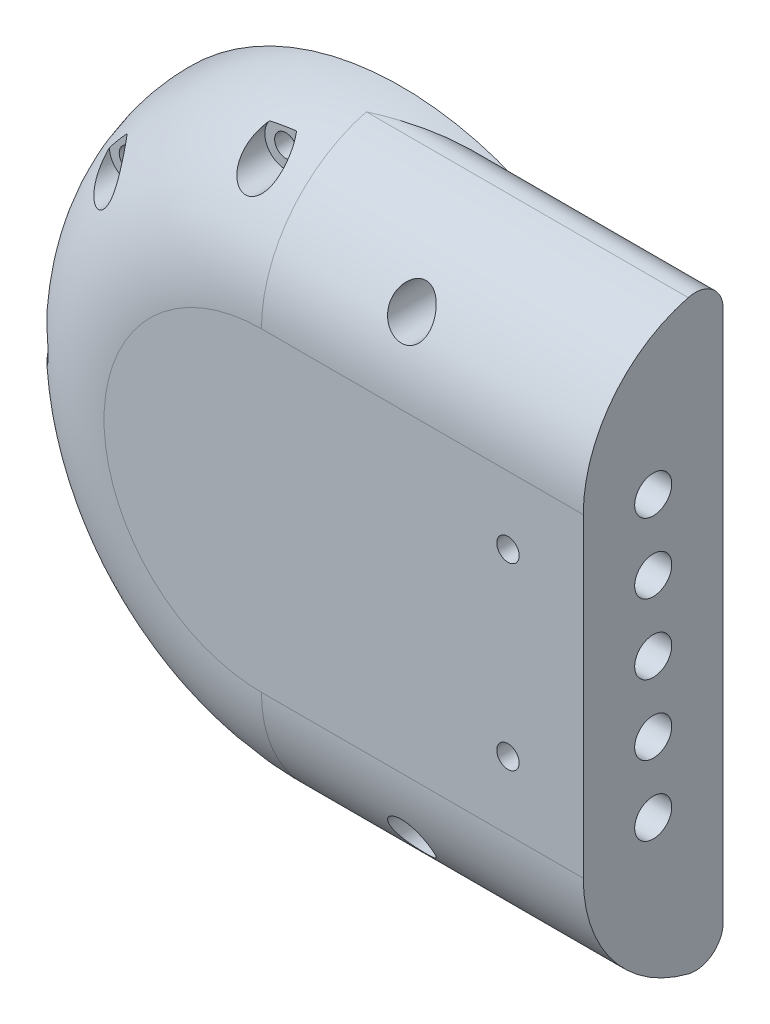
ISO-10303-21;
HEADER;
FILE_DESCRIPTION(('STEP AP214'),'2;1');
FILE_NAME('part.step','',(''),(''),'','','');
FILE_SCHEMA(('AUTOMOTIVE_DESIGN { 1 0 10303 214 1 1 1 1 }'));
ENDSEC;
DATA;
#1=APPLICATION_CONTEXT('core data for automotive mechanical design processes');
#2=APPLICATION_PROTOCOL_DEFINITION('international standard','automotive_design',2000,#1);
#3=PRODUCT_CONTEXT('',#1,'mechanical');
#4=PRODUCT('Part','Part','',(#3));
#5=PRODUCT_RELATED_PRODUCT_CATEGORY('part','',(#4));
#6=PRODUCT_DEFINITION_FORMATION('','',#4);
#7=PRODUCT_DEFINITION_CONTEXT('part definition',#1,'design');
#8=PRODUCT_DEFINITION('design','',#6,#7);
#9=PRODUCT_DEFINITION_SHAPE('','',#8);
#10=(LENGTH_UNIT() NAMED_UNIT(*) SI_UNIT(.MILLI.,.METRE.));
#11=(NAMED_UNIT(*) PLANE_ANGLE_UNIT() SI_UNIT($,.RADIAN.));
#12=(NAMED_UNIT(*) SI_UNIT($,.STERADIAN.) SOLID_ANGLE_UNIT());
#13=UNCERTAINTY_MEASURE_WITH_UNIT(LENGTH_MEASURE(1.E-05),#10,'distance_accuracy_value','');
#14=(GEOMETRIC_REPRESENTATION_CONTEXT(3) GLOBAL_UNCERTAINTY_ASSIGNED_CONTEXT((#13)) GLOBAL_UNIT_ASSIGNED_CONTEXT((#10,
#11,#12)) REPRESENTATION_CONTEXT('',''));
#15=CARTESIAN_POINT('',(0.,0.,0.));
#16=DIRECTION('',(0.,0.,1.));
#17=DIRECTION('',(1.,0.,0.));
#18=AXIS2_PLACEMENT_3D('',#15,#16,#17);
#19=CARTESIAN_POINT('',(46.,37.9919333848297,9.));
#20=DIRECTION('',(0.,0.,-1.));
#21=DIRECTION('',(-1.,0.,0.));
#22=AXIS2_PLACEMENT_3D('',#19,#20,#21);
#23=PLANE('',#22);
#24=CARTESIAN_POINT('',(0.,0.,9.));
#25=DIRECTION('',(0.,0.,1.));
#26=DIRECTION('',(1.,0.,0.));
#27=AXIS2_PLACEMENT_3D('',#24,#25,#26);
#28=CIRCLE('',#27,42.5);
#29=CARTESIAN_POINT('',(19.0489631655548,-37.9919333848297,9.));
#30=VERTEX_POINT('',#29);
#31=CARTESIAN_POINT('',(19.0489631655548,37.9919333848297,9.));
#32=VERTEX_POINT('',#31);
#33=EDGE_CURVE('E41',#30,#32,#28,.F.);
#34=ORIENTED_EDGE('',*,*,#33,.T.);
#35=DIRECTION('',(-1.,0.,0.));
#36=VECTOR('',#35,1.);
#37=CARTESIAN_POINT('',(51.,37.9919333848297,9.));
#38=LINE('',#37,#36);
#39=CARTESIAN_POINT('',(46.,37.9919333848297,9.));
#40=VERTEX_POINT('',#39);
#41=EDGE_CURVE('E364',#32,#40,#38,.F.);
#42=ORIENTED_EDGE('',*,*,#41,.T.);
#43=DIRECTION('',(0.,-1.,0.));
#44=VECTOR('',#43,1.);
#45=CARTESIAN_POINT('',(46.,0.,9.));
#46=LINE('',#45,#44);
#47=CARTESIAN_POINT('',(46.,-37.9919333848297,9.));
#48=VERTEX_POINT('',#47);
#49=EDGE_CURVE('E482',#40,#48,#46,.T.);
#50=ORIENTED_EDGE('',*,*,#49,.T.);
#51=DIRECTION('',(1.,0.,0.));
#52=VECTOR('',#51,1.);
#53=CARTESIAN_POINT('',(0.,-37.9919333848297,9.));
#54=LINE('',#53,#52);
#55=EDGE_CURVE('E361',#48,#30,#54,.F.);
#56=ORIENTED_EDGE('',*,*,#55,.T.);
#57=EDGE_LOOP('',(#34,#42,#50,#56));
#58=FACE_BOUND('',#57,.T.);
#59=CARTESIAN_POINT('',(35.2384732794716,12.8257553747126,9.));
#60=DIRECTION('',(0.,0.,-1.));
#61=DIRECTION('',(-1.,0.,0.));
#62=AXIS2_PLACEMENT_3D('',#59,#60,#61);
#63=CIRCLE('',#62,1.6);
#64=CARTESIAN_POINT('',(33.6384732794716,12.8257553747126,9.));
#65=VERTEX_POINT('',#64);
#66=EDGE_CURVE('E129',#65,#65,#63,.T.);
#67=ORIENTED_EDGE('',*,*,#66,.F.);
#68=EDGE_LOOP('',(#67));
#69=FACE_BOUND('',#68,.T.);
#70=CARTESIAN_POINT('',(35.2384732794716,-12.8257553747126,9.));
#71=DIRECTION('',(0.,0.,-1.));
#72=DIRECTION('',(-1.,0.,0.));
#73=AXIS2_PLACEMENT_3D('',#70,#71,#72);
#74=CIRCLE('',#73,1.6);
#75=CARTESIAN_POINT('',(33.6384732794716,-12.8257553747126,9.));
#76=VERTEX_POINT('',#75);
#77=EDGE_CURVE('E446',#76,#76,#74,.T.);
#78=ORIENTED_EDGE('',*,*,#77,.F.);
#79=EDGE_LOOP('',(#78));
#80=FACE_BOUND('',#79,.T.);
#81=CARTESIAN_POINT('',(18.75,-32.4759526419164,9.));
#82=DIRECTION('',(0.,0.,-1.));
#83=DIRECTION('',(-1.,0.,0.));
#84=AXIS2_PLACEMENT_3D('',#81,#82,#83);
#85=CIRCLE('',#84,1.6);
#86=CARTESIAN_POINT('',(17.15,-32.4759526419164,9.));
#87=VERTEX_POINT('',#86);
#88=EDGE_CURVE('E449',#87,#87,#85,.T.);
#89=ORIENTED_EDGE('',*,*,#88,.F.);
#90=EDGE_LOOP('',(#89));
#91=FACE_BOUND('',#90,.T.);
#92=CARTESIAN_POINT('',(18.75,32.4759526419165,9.));
#93=DIRECTION('',(0.,0.,-1.));
#94=DIRECTION('',(-1.,0.,0.));
#95=AXIS2_PLACEMENT_3D('',#92,#93,#94);
#96=CIRCLE('',#95,1.59999999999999);
#97=CARTESIAN_POINT('',(17.15,32.4759526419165,9.));
#98=VERTEX_POINT('',#97);
#99=EDGE_CURVE('E452',#98,#98,#96,.T.);
#100=ORIENTED_EDGE('',*,*,#99,.F.);
#101=EDGE_LOOP('',(#100));
#102=FACE_BOUND('',#101,.T.);
#103=CARTESIAN_POINT('',(-28.7266666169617,-24.1045353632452,9.));
#104=DIRECTION('',(0.,0.,-1.));
#105=DIRECTION('',(-1.,0.,0.));
#106=AXIS2_PLACEMENT_3D('',#103,#104,#105);
#107=CIRCLE('',#106,1.6);
#108=CARTESIAN_POINT('',(-30.3266666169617,-24.1045353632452,9.));
#109=VERTEX_POINT('',#108);
#110=EDGE_CURVE('E455',#109,#109,#107,.T.);
#111=ORIENTED_EDGE('',*,*,#110,.F.);
#112=EDGE_LOOP('',(#111));
#113=FACE_BOUND('',#112,.T.);
#114=CARTESIAN_POINT('',(-6.51180666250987,-36.9302907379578,9.));
#115=DIRECTION('',(0.,0.,-1.));
#116=DIRECTION('',(-1.,0.,0.));
#117=AXIS2_PLACEMENT_3D('',#114,#115,#116);
#118=CIRCLE('',#117,1.6);
#119=CARTESIAN_POINT('',(-8.11180666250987,-36.9302907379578,9.));
#120=VERTEX_POINT('',#119);
#121=EDGE_CURVE('E458',#120,#120,#118,.T.);
#122=ORIENTED_EDGE('',*,*,#121,.F.);
#123=EDGE_LOOP('',(#122));
#124=FACE_BOUND('',#123,.T.);
#125=CARTESIAN_POINT('',(-37.5,0.,9.));
#126=DIRECTION('',(0.,0.,-1.));
#127=DIRECTION('',(-1.,0.,0.));
#128=AXIS2_PLACEMENT_3D('',#125,#126,#127);
#129=CIRCLE('',#128,1.6);
#130=CARTESIAN_POINT('',(-39.1,0.,9.));
#131=VERTEX_POINT('',#130);
#132=EDGE_CURVE('E461',#131,#131,#129,.T.);
#133=ORIENTED_EDGE('',*,*,#132,.F.);
#134=EDGE_LOOP('',(#133));
#135=FACE_BOUND('',#134,.T.);
#136=CARTESIAN_POINT('',(-28.7266666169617,24.1045353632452,9.));
#137=DIRECTION('',(0.,0.,-1.));
#138=DIRECTION('',(-1.,0.,0.));
#139=AXIS2_PLACEMENT_3D('',#136,#137,#138);
#140=CIRCLE('',#139,1.6);
#141=CARTESIAN_POINT('',(-30.3266666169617,24.1045353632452,9.));
#142=VERTEX_POINT('',#141);
#143=EDGE_CURVE('E464',#142,#142,#140,.T.);
#144=ORIENTED_EDGE('',*,*,#143,.F.);
#145=EDGE_LOOP('',(#144));
#146=FACE_BOUND('',#145,.T.);
#147=CARTESIAN_POINT('',(-6.51180666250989,36.9302907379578,9.));
#148=DIRECTION('',(0.,0.,-1.));
#149=DIRECTION('',(-1.,0.,0.));
#150=AXIS2_PLACEMENT_3D('',#147,#148,#149);
#151=CIRCLE('',#150,1.6);
#152=CARTESIAN_POINT('',(-8.11180666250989,36.9302907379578,9.));
#153=VERTEX_POINT('',#152);
#154=EDGE_CURVE('E466',#153,#153,#151,.T.);
#155=ORIENTED_EDGE('',*,*,#154,.F.);
#156=EDGE_LOOP('',(#155));
#157=FACE_BOUND('',#156,.T.);
#158=ADVANCED_FACE('F37',(#58,#69,#80,#91,#102,#113,#124,#135,#146,#157),#23,.T.);
#159=CARTESIAN_POINT('',(40.,-20.,19.));
#160=DIRECTION('',(1.,0.,0.));
#161=DIRECTION('',(0.,0.,-1.));
#162=AXIS2_PLACEMENT_3D('',#159,#160,#161);
#163=PLANE('',#162);
#164=CARTESIAN_POINT('',(40.,-20.,19.));
#165=DIRECTION('',(1.,0.,0.));
#166=DIRECTION('',(0.,1.,0.));
#167=AXIS2_PLACEMENT_3D('',#164,#165,#166);
#168=CIRCLE('',#167,2.65);
#169=CARTESIAN_POINT('',(40.,-17.35,19.));
#170=VERTEX_POINT('',#169);
#171=EDGE_CURVE('E390',#170,#170,#168,.T.);
#172=ORIENTED_EDGE('',*,*,#171,.T.);
#173=EDGE_LOOP('',(#172));
#174=FACE_BOUND('',#173,.T.);
#175=ADVANCED_FACE('F203',(#174),#163,.T.);
#176=CARTESIAN_POINT('',(40.,-10.,19.));
#177=DIRECTION('',(1.,0.,0.));
#178=DIRECTION('',(0.,0.,-1.));
#179=AXIS2_PLACEMENT_3D('',#176,#177,#178);
#180=PLANE('',#179);
#181=CARTESIAN_POINT('',(40.,-10.,19.));
#182=DIRECTION('',(1.,0.,0.));
#183=DIRECTION('',(0.,1.,0.));
#184=AXIS2_PLACEMENT_3D('',#181,#182,#183);
#185=CIRCLE('',#184,2.65);
#186=CARTESIAN_POINT('',(40.,-7.35,19.));
#187=VERTEX_POINT('',#186);
#188=EDGE_CURVE('E396',#187,#187,#185,.T.);
#189=ORIENTED_EDGE('',*,*,#188,.T.);
#190=EDGE_LOOP('',(#189));
#191=FACE_BOUND('',#190,.T.);
#192=ADVANCED_FACE('F244',(#191),#180,.T.);
#193=CARTESIAN_POINT('',(40.,0.,19.));
#194=DIRECTION('',(1.,0.,0.));
#195=DIRECTION('',(0.,0.,-1.));
#196=AXIS2_PLACEMENT_3D('',#193,#194,#195);
#197=PLANE('',#196);
#198=CARTESIAN_POINT('',(40.,0.,19.));
#199=DIRECTION('',(1.,0.,0.));
#200=DIRECTION('',(0.,1.,0.));
#201=AXIS2_PLACEMENT_3D('',#198,#199,#200);
#202=CIRCLE('',#201,2.65);
#203=CARTESIAN_POINT('',(40.,2.65,19.));
#204=VERTEX_POINT('',#203);
#205=EDGE_CURVE('E402',#204,#204,#202,.T.);
#206=ORIENTED_EDGE('',*,*,#205,.T.);
#207=EDGE_LOOP('',(#206));
#208=FACE_BOUND('',#207,.T.);
#209=ADVANCED_FACE('F250',(#208),#197,.T.);
#210=CARTESIAN_POINT('',(40.,10.,19.));
#211=DIRECTION('',(1.,0.,0.));
#212=DIRECTION('',(0.,0.,-1.));
#213=AXIS2_PLACEMENT_3D('',#210,#211,#212);
#214=PLANE('',#213);
#215=CARTESIAN_POINT('',(40.,10.,19.));
#216=DIRECTION('',(1.,0.,0.));
#217=DIRECTION('',(0.,1.,0.));
#218=AXIS2_PLACEMENT_3D('',#215,#216,#217);
#219=CIRCLE('',#218,2.65);
#220=CARTESIAN_POINT('',(40.,12.65,19.));
#221=VERTEX_POINT('',#220);
#222=EDGE_CURVE('E408',#221,#221,#219,.T.);
#223=ORIENTED_EDGE('',*,*,#222,.T.);
#224=EDGE_LOOP('',(#223));
#225=FACE_BOUND('',#224,.T.);
#226=ADVANCED_FACE('F261',(#225),#214,.T.);
#227=CARTESIAN_POINT('',(40.,20.,19.));
#228=DIRECTION('',(1.,0.,0.));
#229=DIRECTION('',(0.,0.,-1.));
#230=AXIS2_PLACEMENT_3D('',#227,#228,#229);
#231=PLANE('',#230);
#232=CARTESIAN_POINT('',(40.,20.,19.));
#233=DIRECTION('',(1.,0.,0.));
#234=DIRECTION('',(0.,1.,0.));
#235=AXIS2_PLACEMENT_3D('',#232,#233,#234);
#236=CIRCLE('',#235,2.65);
#237=CARTESIAN_POINT('',(40.,22.65,19.));
#238=VERTEX_POINT('',#237);
#239=EDGE_CURVE('E378',#238,#238,#236,.T.);
#240=ORIENTED_EDGE('',*,*,#239,.T.);
#241=EDGE_LOOP('',(#240));
#242=FACE_BOUND('',#241,.T.);
#243=ADVANCED_FACE('F257',(#242),#231,.T.);
#244=CARTESIAN_POINT('',(18.7508502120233,32.4754617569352,29.));
#245=DIRECTION('',(0.,0.,-1.));
#246=DIRECTION('',(-1.,0.,0.));
#247=AXIS2_PLACEMENT_3D('',#244,#245,#246);
#248=CYLINDRICAL_SURFACE('',#247,3.);
#249=CARTESIAN_POINT('',(15.7508502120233,32.4754617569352,26.3346520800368));
#250=CARTESIAN_POINT('',(15.7508566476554,32.6970317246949,26.2071360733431));
#251=CARTESIAN_POINT('',(15.7754238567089,32.9163204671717,26.0752241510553));
#252=CARTESIAN_POINT('',(15.8706116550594,33.3427273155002,25.8077050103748));
#253=CARTESIAN_POINT('',(15.9413351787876,33.5498170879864,25.6720901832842));
#254=CARTESIAN_POINT('',(16.1168233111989,33.9246670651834,25.4171551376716));
#255=CARTESIAN_POINT('',(16.2173096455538,34.0942796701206,25.2976005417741));
#256=CARTESIAN_POINT('',(16.4523335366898,34.4134996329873,25.0657168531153));
#257=CARTESIAN_POINT('',(16.5868064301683,34.5631441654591,24.9533745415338));
#258=CARTESIAN_POINT('',(16.8503217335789,34.801616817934,24.7698076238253));
#259=CARTESIAN_POINT('',(16.9719572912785,34.8962107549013,24.6954152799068));
#260=CARTESIAN_POINT('',(17.2329710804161,35.0678249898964,24.5583352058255));
#261=CARTESIAN_POINT('',(17.3723244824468,35.1448694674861,24.4956313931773));
#262=CARTESIAN_POINT('',(17.6408008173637,35.2657066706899,24.3961609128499));
#263=CARTESIAN_POINT('',(17.7673791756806,35.3129696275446,24.3567688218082));
#264=CARTESIAN_POINT('',(18.0290278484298,35.3905163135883,24.2917353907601));
#265=CARTESIAN_POINT('',(18.1640920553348,35.4208121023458,24.2660842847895));
#266=CARTESIAN_POINT('',(18.4399224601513,35.4625780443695,24.2306387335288));
#267=CARTESIAN_POINT('',(18.5807143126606,35.4739510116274,24.2209261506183));
#268=CARTESIAN_POINT('',(18.8626332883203,35.4766887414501,24.2185925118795));
#269=CARTESIAN_POINT('',(19.003760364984,35.4680561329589,24.2259692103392));
#270=CARTESIAN_POINT('',(19.2699920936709,35.432998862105,24.2557525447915));
#271=CARTESIAN_POINT('',(19.3954542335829,35.4081107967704,24.2768605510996));
#272=CARTESIAN_POINT('',(19.6397189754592,35.3435420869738,24.3311837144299));
#273=CARTESIAN_POINT('',(19.7585203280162,35.3038586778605,24.3644011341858));
#274=CARTESIAN_POINT('',(19.9962747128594,35.2079690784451,24.4438227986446));
#275=CARTESIAN_POINT('',(20.1145365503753,35.1507267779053,24.4908294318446));
#276=CARTESIAN_POINT('',(20.3396812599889,35.0234755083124,24.5938860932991));
#277=CARTESIAN_POINT('',(20.4465547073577,34.9534560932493,24.6499435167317));
#278=CARTESIAN_POINT('',(20.6957981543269,34.7670757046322,24.7967936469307));
#279=CARTESIAN_POINT('',(20.8311818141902,34.6444199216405,24.891511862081));
#280=CARTESIAN_POINT('',(21.0751180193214,34.3807525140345,25.0895933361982));
#281=CARTESIAN_POINT('',(21.1836299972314,34.2397136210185,25.1929693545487));
#282=CARTESIAN_POINT('',(21.374276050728,33.9415021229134,25.4050557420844));
#283=CARTESIAN_POINT('',(21.4561070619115,33.7841692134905,25.5138122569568));
#284=CARTESIAN_POINT('',(21.5908504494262,33.4580691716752,25.7319819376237));
#285=CARTESIAN_POINT('',(21.6437661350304,33.2893033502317,25.8413950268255));
#286=CARTESIAN_POINT('',(21.7238314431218,32.9232407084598,26.0706756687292));
#287=CARTESIAN_POINT('',(21.7472105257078,32.7249251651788,26.190256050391));
#288=CARTESIAN_POINT('',(21.753698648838,32.3234373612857,26.4227929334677));
#289=CARTESIAN_POINT('',(21.7368024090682,32.1202644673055,26.5357485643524));
#290=CARTESIAN_POINT('',(21.680480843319,31.8220565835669,26.6949534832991));
#291=CARTESIAN_POINT('',(21.6574037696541,31.725893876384,26.7452651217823));
#292=CARTESIAN_POINT('',(21.6013873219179,31.5350867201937,26.8431682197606));
#293=CARTESIAN_POINT('',(21.5684531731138,31.4404414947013,26.8907611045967));
#294=CARTESIAN_POINT('',(21.4926562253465,31.253720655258,26.9828590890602));
#295=CARTESIAN_POINT('',(21.4497983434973,31.1616437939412,27.0273657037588));
#296=CARTESIAN_POINT('',(21.3541889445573,30.9811212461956,27.1129941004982));
#297=CARTESIAN_POINT('',(21.3014389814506,30.8926749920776,27.1541164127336));
#298=CARTESIAN_POINT('',(21.1932099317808,30.7309942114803,27.2279361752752));
#299=CARTESIAN_POINT('',(21.138830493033,30.6572128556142,27.2610512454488));
#300=CARTESIAN_POINT('',(21.022834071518,30.5141955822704,27.324267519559));
#301=CARTESIAN_POINT('',(20.9612181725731,30.4449589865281,27.3543691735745));
#302=CARTESIAN_POINT('',(20.8311329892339,30.311883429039,27.4114018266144));
#303=CARTESIAN_POINT('',(20.7626673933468,30.2480415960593,27.4383345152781));
#304=CARTESIAN_POINT('',(20.6193808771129,30.126540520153,27.4889213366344));
#305=CARTESIAN_POINT('',(20.5445605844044,30.0688806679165,27.5125757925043));
#306=CARTESIAN_POINT('',(20.3283855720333,29.9181631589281,27.5736832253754));
#307=CARTESIAN_POINT('',(20.1806452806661,29.8325652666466,27.6075119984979));
#308=CARTESIAN_POINT('',(19.8711217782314,29.6872294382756,27.6641335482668));
#309=CARTESIAN_POINT('',(19.7093444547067,29.6274807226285,27.6869309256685));
#310=CARTESIAN_POINT('',(19.3872392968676,29.5392866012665,27.7203238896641));
#311=CARTESIAN_POINT('',(19.2274521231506,29.5091190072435,27.7315926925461));
#312=CARTESIAN_POINT('',(18.9047314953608,29.4750222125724,27.7443168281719));
#313=CARTESIAN_POINT('',(18.7417986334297,29.471088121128,27.745773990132));
#314=CARTESIAN_POINT('',(18.4215555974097,29.4893816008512,27.7389600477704));
#315=CARTESIAN_POINT('',(18.2642042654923,29.5109842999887,27.7309213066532));
#316=CARTESIAN_POINT('',(17.9555965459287,29.5784775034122,27.7055190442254));
#317=CARTESIAN_POINT('',(17.8043399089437,29.6243670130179,27.6881559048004));
#318=CARTESIAN_POINT('',(17.511565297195,29.7388647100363,27.6441032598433));
#319=CARTESIAN_POINT('',(17.3700813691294,29.8075479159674,27.6173829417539));
#320=CARTESIAN_POINT('',(17.1010293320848,29.9650046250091,27.554806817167));
#321=CARTESIAN_POINT('',(16.9734619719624,30.053779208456,27.5189505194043));
#322=CARTESIAN_POINT('',(16.7315829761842,30.2511322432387,27.4372356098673));
#323=CARTESIAN_POINT('',(16.6177789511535,30.3602215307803,27.3911110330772));
#324=CARTESIAN_POINT('',(16.4101996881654,30.5924757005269,27.2901028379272));
#325=CARTESIAN_POINT('',(16.3164312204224,30.7156453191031,27.2352162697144));
#326=CARTESIAN_POINT('',(16.145016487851,30.9801370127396,27.1137992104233));
#327=CARTESIAN_POINT('',(16.068746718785,31.1221127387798,27.0467549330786));
#328=CARTESIAN_POINT('',(15.9408048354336,31.4129670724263,26.9048928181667));
#329=CARTESIAN_POINT('',(15.8891277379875,31.5618442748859,26.830076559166));
#330=CARTESIAN_POINT('',(15.816313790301,31.8385985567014,26.6864606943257));
#331=CARTESIAN_POINT('',(15.7916261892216,31.9660484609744,26.6185975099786));
#332=CARTESIAN_POINT('',(15.7588895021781,32.2210686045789,26.4791878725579));
#333=CARTESIAN_POINT('',(15.7508465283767,32.3486388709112,26.4076400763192));
#334=CARTESIAN_POINT('',(15.7508502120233,32.4754617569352,26.3346520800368));
#335=B_SPLINE_CURVE_WITH_KNOTS('',3,(#249,#250,#251,#252,#253,#254,#255,#256,#257,#258,#259,
#260,#261,#262,#263,#264,#265,#266,#267,#268,#269,#270,#271,#272,#273,#274,#275,#276,#277,#278,
#279,#280,#281,#282,#283,#284,#285,#286,#287,#288,#289,#290,#291,#292,#293,#294,#295,#296,#297,
#298,#299,#300,#301,#302,#303,#304,#305,#306,#307,#308,#309,#310,#311,#312,#313,#314,#315,#316,
#317,#318,#319,#320,#321,#322,#323,#324,#325,#326,#327,#328,#329,#330,#331,#332,#333,#334),
.UNSPECIFIED.,.T.,.F.,(4,2,2,2,2,2,2,2,2,2,2,2,2,2,2,2,2,2,2,2,2,2,2,2,2,2,2,2,2,2,2,2,2,2,2,2,
2,2,2,2,2,2,4),(0.,0.76626691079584,1.53424856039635,2.22278490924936,2.91002097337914,
3.42149547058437,3.93226093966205,4.35275736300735,4.77295453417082,5.19530321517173,
5.61759639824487,6.00483075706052,6.39213751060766,6.80923486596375,7.22667476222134,
7.84070517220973,8.4556569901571,9.07736852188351,9.69900888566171,10.3938946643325,
11.0888715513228,11.4213453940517,11.7536433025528,12.0857769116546,12.4178583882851,
12.7098199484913,13.001737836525,13.2934993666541,13.5852321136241,14.1044618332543,
14.6234748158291,15.1100685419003,15.5965715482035,16.0714123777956,16.5462337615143,
17.02263363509,17.4990591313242,17.9896662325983,18.48043885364,19.0019301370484,
19.5233157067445,19.9617528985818,20.4003510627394),.UNSPECIFIED.);
#336=CARTESIAN_POINT('',(15.7508502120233,32.4754617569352,26.3346520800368));
#337=VERTEX_POINT('',#336);
#338=EDGE_CURVE('E324',#337,#337,#335,.T.);
#339=ORIENTED_EDGE('',*,*,#338,.F.);
#340=EDGE_LOOP('',(#339));
#341=FACE_BOUND('',#340,.T.);
#342=CARTESIAN_POINT('',(18.7508502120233,32.4754617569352,19.));
#343=DIRECTION('',(0.,0.,1.));
#344=DIRECTION('',(1.,0.,0.));
#345=AXIS2_PLACEMENT_3D('',#342,#343,#344);
#346=CIRCLE('',#345,3.);
#347=CARTESIAN_POINT('',(21.7508502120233,32.4754617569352,19.));
#348=VERTEX_POINT('',#347);
#349=EDGE_CURVE('E440',#348,#348,#346,.T.);
#350=ORIENTED_EDGE('',*,*,#349,.F.);
#351=EDGE_LOOP('',(#350));
#352=FACE_BOUND('',#351,.T.);
#353=ADVANCED_FACE('F260',(#341,#352),#248,.F.);
#354=CARTESIAN_POINT('',(18.75,-32.4759526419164,29.));
#355=DIRECTION('',(0.,0.,-1.));
#356=DIRECTION('',(-1.,0.,0.));
#357=AXIS2_PLACEMENT_3D('',#354,#355,#356);
#358=CYLINDRICAL_SURFACE('',#357,3.);
#359=CARTESIAN_POINT('',(15.75,-32.4759526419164,26.3343695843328));
#360=CARTESIAN_POINT('',(15.7500024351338,-32.2989450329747,26.4362372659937));
#361=CARTESIAN_POINT('',(15.7656730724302,-32.1203334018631,26.5353899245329));
#362=CARTESIAN_POINT('',(15.8299320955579,-31.7647440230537,26.7258331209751));
#363=CARTESIAN_POINT('',(15.878515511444,-31.5877660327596,26.8171248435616));
#364=CARTESIAN_POINT('',(16.0098791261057,-31.2404900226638,26.9900432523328));
#365=CARTESIAN_POINT('',(16.092840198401,-31.0702326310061,27.0716158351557));
#366=CARTESIAN_POINT('',(16.2925558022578,-30.7446635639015,27.2224507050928));
#367=CARTESIAN_POINT('',(16.4092910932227,-30.5893434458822,27.2917199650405));
#368=CARTESIAN_POINT('',(16.6606069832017,-30.3160098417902,27.4100506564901));
#369=CARTESIAN_POINT('',(16.7921821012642,-30.1958110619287,27.4604482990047));
#370=CARTESIAN_POINT('',(17.0771768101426,-29.9792285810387,27.54925545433));
#371=CARTESIAN_POINT('',(17.2305835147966,-29.8828309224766,27.5876719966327));
#372=CARTESIAN_POINT('',(17.5398170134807,-29.7258970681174,27.6492065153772));
#373=CARTESIAN_POINT('',(17.6942012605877,-29.6629252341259,27.6733851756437));
#374=CARTESIAN_POINT('',(18.012439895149,-29.5632605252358,27.7113127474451));
#375=CARTESIAN_POINT('',(18.1762913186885,-29.5265594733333,27.7250649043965));
#376=CARTESIAN_POINT('',(18.5008136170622,-29.4820386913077,27.7417094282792));
#377=CARTESIAN_POINT('',(18.6612932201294,-29.4729878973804,27.7450647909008));
#378=CARTESIAN_POINT('',(18.981544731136,-29.4806178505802,27.7422248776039));
#379=CARTESIAN_POINT('',(19.1413167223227,-29.4972954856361,27.7360307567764));
#380=CARTESIAN_POINT('',(19.4535840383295,-29.5553559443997,27.7142427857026));
#381=CARTESIAN_POINT('',(19.6061446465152,-29.5964327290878,27.6987653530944));
#382=CARTESIAN_POINT('',(19.9018664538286,-29.701457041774,27.6585679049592));
#383=CARTESIAN_POINT('',(20.0450276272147,-29.7654046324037,27.6338478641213));
#384=CARTESIAN_POINT('',(20.3200926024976,-29.9147750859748,27.5749188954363));
#385=CARTESIAN_POINT('',(20.4518192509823,-30.0004750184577,27.54058690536));
#386=CARTESIAN_POINT('',(20.6986990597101,-30.1897377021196,27.4628918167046));
#387=CARTESIAN_POINT('',(20.8138500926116,-30.2933027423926,27.4195275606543));
#388=CARTESIAN_POINT('',(21.0297467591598,-30.5193746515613,27.3222641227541));
#389=CARTESIAN_POINT('',(21.129684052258,-30.6424944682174,27.2679989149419));
#390=CARTESIAN_POINT('',(21.3075469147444,-30.9000486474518,27.1510107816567));
#391=CARTESIAN_POINT('',(21.3854663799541,-31.0344861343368,27.088285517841));
#392=CARTESIAN_POINT('',(21.5237863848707,-31.3212446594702,26.9502874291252));
#393=CARTESIAN_POINT('',(21.5823861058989,-31.474146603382,26.8744213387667));
#394=CARTESIAN_POINT('',(21.673553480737,-31.7838993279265,26.7155176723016));
#395=CARTESIAN_POINT('',(21.7061099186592,-31.9407517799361,26.6324770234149));
#396=CARTESIAN_POINT('',(21.7481594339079,-32.2715800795,26.4515174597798));
#397=CARTESIAN_POINT('',(21.7547748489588,-32.4455717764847,26.3529610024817));
#398=CARTESIAN_POINT('',(21.7385411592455,-32.7894646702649,26.1512894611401));
#399=CARTESIAN_POINT('',(21.7156802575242,-32.9593642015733,26.048172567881));
#400=CARTESIAN_POINT('',(21.6378893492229,-33.3101469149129,25.8281962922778));
#401=CARTESIAN_POINT('',(21.5796701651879,-33.4901448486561,25.7110858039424));
#402=CARTESIAN_POINT('',(21.4301644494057,-33.83699149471,25.477752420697));
#403=CARTESIAN_POINT('',(21.3388353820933,-34.0038229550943,25.3615308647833));
#404=CARTESIAN_POINT('',(21.1753822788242,-34.2444290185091,25.1888487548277));
#405=CARTESIAN_POINT('',(21.1148179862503,-34.3246905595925,25.1302812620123));
#406=CARTESIAN_POINT('',(20.9850154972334,-34.4796856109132,25.0155065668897));
#407=CARTESIAN_POINT('',(20.9157756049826,-34.5544180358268,24.959299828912));
#408=CARTESIAN_POINT('',(20.6953819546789,-34.7688367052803,24.7958103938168));
#409=CARTESIAN_POINT('',(20.5311425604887,-34.8993609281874,24.6932110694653));
#410=CARTESIAN_POINT('',(20.2333361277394,-35.0872875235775,24.5425025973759));
#411=CARTESIAN_POINT('',(20.1090226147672,-35.1543213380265,24.4878636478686));
#412=CARTESIAN_POINT('',(19.8478844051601,-35.2714864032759,24.3913899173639));
#413=CARTESIAN_POINT('',(19.7110720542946,-35.3216341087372,24.3495426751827));
#414=CARTESIAN_POINT('',(19.4982116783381,-35.3821048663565,24.2987604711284));
#415=CARTESIAN_POINT('',(19.425613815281,-35.3998528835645,24.2837882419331));
#416=CARTESIAN_POINT('',(19.2785567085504,-35.4299749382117,24.25831376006));
#417=CARTESIAN_POINT('',(19.20409845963,-35.4423517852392,24.2478091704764));
#418=CARTESIAN_POINT('',(19.0539713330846,-35.4614716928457,24.2315597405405));
#419=CARTESIAN_POINT('',(18.9783029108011,-35.4682168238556,24.2258131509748));
#420=CARTESIAN_POINT('',(18.8264854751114,-35.4759421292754,24.2192294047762));
#421=CARTESIAN_POINT('',(18.7503365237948,-35.4769230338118,24.2183916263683));
#422=CARTESIAN_POINT('',(18.5420696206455,-35.4716486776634,24.2228908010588));
#423=CARTESIAN_POINT('',(18.4101324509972,-35.4595170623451,24.2332425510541));
#424=CARTESIAN_POINT('',(18.1509356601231,-35.4184667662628,24.268068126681));
#425=CARTESIAN_POINT('',(18.0236765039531,-35.3895464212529,24.2925433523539));
#426=CARTESIAN_POINT('',(17.7764122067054,-35.3165140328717,24.3538015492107));
#427=CARTESIAN_POINT('',(17.6564262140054,-35.2723637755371,24.3906154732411));
#428=CARTESIAN_POINT('',(17.4259277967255,-35.1708972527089,24.4742588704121));
#429=CARTESIAN_POINT('',(17.3154214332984,-35.1135726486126,24.521094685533));
#430=CARTESIAN_POINT('',(17.0589302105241,-34.9601664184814,24.6447328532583));
#431=CARTESIAN_POINT('',(16.9185164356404,-34.8580899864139,24.7256914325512));
#432=CARTESIAN_POINT('',(16.6606153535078,-34.6354881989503,24.8981070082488));
#433=CARTESIAN_POINT('',(16.5431654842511,-34.5149332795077,24.9895807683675));
#434=CARTESIAN_POINT('',(16.3302845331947,-34.2573175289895,25.1799715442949));
#435=CARTESIAN_POINT('',(16.2351783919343,-34.12005254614,25.2789736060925));
#436=CARTESIAN_POINT('',(16.0695860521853,-33.8334402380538,25.4797987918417));
#437=CARTESIAN_POINT('',(15.9990930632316,-33.6840962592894,25.5816211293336));
#438=CARTESIAN_POINT('',(15.878617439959,-33.3630530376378,25.7938704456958));
#439=CARTESIAN_POINT('',(15.83083701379,-33.1905282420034,25.9043064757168));
#440=CARTESIAN_POINT('',(15.7665252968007,-32.8378845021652,26.1222398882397));
#441=CARTESIAN_POINT('',(15.7499974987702,-32.6577647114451,26.229736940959));
#442=CARTESIAN_POINT('',(15.75,-32.4759526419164,26.3343695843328));
#443=B_SPLINE_CURVE_WITH_KNOTS('',3,(#359,#360,#361,#362,#363,#364,#365,#366,#367,#368,#369,
#370,#371,#372,#373,#374,#375,#376,#377,#378,#379,#380,#381,#382,#383,#384,#385,#386,#387,#388,
#389,#390,#391,#392,#393,#394,#395,#396,#397,#398,#399,#400,#401,#402,#403,#404,#405,#406,#407,
#408,#409,#410,#411,#412,#413,#414,#415,#416,#417,#418,#419,#420,#421,#422,#423,#424,#425,#426,
#427,#428,#429,#430,#431,#432,#433,#434,#435,#436,#437,#438,#439,#440,#441,#442),.UNSPECIFIED.,
.T.,.F.,(4,2,2,2,2,2,2,2,2,2,2,2,2,2,2,2,2,2,2,2,2,2,2,2,2,2,2,2,2,2,2,2,2,2,2,2,2,2,2,2,2,4),
(0.,0.612040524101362,1.22398864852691,1.83919818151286,2.45405792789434,3.00663460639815,
3.55888646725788,4.06176498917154,4.56448691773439,5.04447382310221,5.52440267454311,
5.99843524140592,6.47246910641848,6.95287381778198,7.43334013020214,7.93398976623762,
8.43477806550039,8.97395516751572,9.51336434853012,10.1111566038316,10.7091881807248,
11.3738489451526,12.0393666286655,12.3880157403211,12.7367331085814,13.4316070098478,
13.8843538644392,14.3366582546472,14.5650352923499,14.793292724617,15.021466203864,
15.2496107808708,15.6461738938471,16.0427763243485,16.4403812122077,16.8382384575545,
17.4097761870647,17.982238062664,18.5625707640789,19.1427432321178,19.7713259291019,
20.3999788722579),.UNSPECIFIED.);
#444=CARTESIAN_POINT('',(15.75,-32.4759526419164,26.3343695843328));
#445=VERTEX_POINT('',#444);
#446=EDGE_CURVE('E302',#445,#445,#443,.T.);
#447=ORIENTED_EDGE('',*,*,#446,.F.);
#448=EDGE_LOOP('',(#447));
#449=FACE_BOUND('',#448,.T.);
#450=CARTESIAN_POINT('',(18.75,-32.4759526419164,19.));
#451=DIRECTION('',(0.,0.,1.));
#452=DIRECTION('',(1.,0.,0.));
#453=AXIS2_PLACEMENT_3D('',#450,#451,#452);
#454=CIRCLE('',#453,3.);
#455=CARTESIAN_POINT('',(21.75,-32.4759526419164,19.));
#456=VERTEX_POINT('',#455);
#457=EDGE_CURVE('E437',#456,#456,#454,.T.);
#458=ORIENTED_EDGE('',*,*,#457,.F.);
#459=EDGE_LOOP('',(#458));
#460=FACE_BOUND('',#459,.T.);
#461=ADVANCED_FACE('F314',(#449,#460),#358,.F.);
#462=CARTESIAN_POINT('',(-37.5,0.,29.));
#463=DIRECTION('',(0.,0.,-1.));
#464=DIRECTION('',(-1.,0.,0.));
#465=AXIS2_PLACEMENT_3D('',#462,#463,#464);
#466=CYLINDRICAL_SURFACE('',#465,3.);
#467=CARTESIAN_POINT('',(-37.5,0.,19.));
#468=DIRECTION('',(0.,0.,1.));
#469=DIRECTION('',(1.,0.,0.));
#470=AXIS2_PLACEMENT_3D('',#467,#468,#469);
#471=CIRCLE('',#470,3.);
#472=CARTESIAN_POINT('',(-39.7723048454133,-1.95873190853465,19.));
#473=VERTEX_POINT('',#472);
#474=CARTESIAN_POINT('',(-39.7723048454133,1.95873190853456,19.));
#475=VERTEX_POINT('',#474);
#476=EDGE_CURVE('E11',#473,#475,#471,.T.);
#477=ORIENTED_EDGE('',*,*,#476,.F.);
#478=CARTESIAN_POINT('',(-39.7724274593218,1.95858965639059,18.9998));
#479=CARTESIAN_POINT('',(-39.7306344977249,2.00706082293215,19.0679753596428));
#480=CARTESIAN_POINT('',(-39.6878583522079,2.05357262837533,19.1369171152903));
#481=CARTESIAN_POINT('',(-39.6004785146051,2.14287431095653,19.2760059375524));
#482=CARTESIAN_POINT('',(-39.5558754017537,2.18566535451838,19.3461526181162));
#483=CARTESIAN_POINT('',(-39.464996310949,2.26771433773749,19.4873013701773));
#484=CARTESIAN_POINT('',(-39.4187219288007,2.30697552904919,19.5583025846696));
#485=CARTESIAN_POINT('',(-39.3245514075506,2.3821506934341,19.70100290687));
#486=CARTESIAN_POINT('',(-39.2766550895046,2.41806429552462,19.7727020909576));
#487=CARTESIAN_POINT('',(-39.1302668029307,2.52121672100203,19.9891243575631));
#488=CARTESIAN_POINT('',(-39.0294257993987,2.58355366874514,20.1346268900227));
#489=CARTESIAN_POINT('',(-38.8220339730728,2.69557288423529,20.42646764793));
#490=CARTESIAN_POINT('',(-38.7154812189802,2.74525083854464,20.5728061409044));
#491=CARTESIAN_POINT('',(-38.4929036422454,2.83355341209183,20.8710209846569));
#492=CARTESIAN_POINT('',(-38.3766718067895,2.87167553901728,21.02289235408));
#493=CARTESIAN_POINT('',(-38.1391034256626,2.93370347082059,21.3255349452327));
#494=CARTESIAN_POINT('',(-38.0177672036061,2.95761017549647,21.4763062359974));
#495=CARTESIAN_POINT('',(-37.7707442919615,2.99035163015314,21.7756870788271));
#496=CARTESIAN_POINT('',(-37.6450622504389,2.99920200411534,21.9242987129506));
#497=CARTESIAN_POINT('',(-37.3901408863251,3.00069472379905,22.218435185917));
#498=CARTESIAN_POINT('',(-37.2609028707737,2.99334294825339,22.3639611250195));
#499=CARTESIAN_POINT('',(-36.9483432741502,2.95454961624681,22.7075485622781));
#500=CARTESIAN_POINT('',(-36.7638107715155,2.91474433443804,22.9036718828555));
#501=CARTESIAN_POINT('',(-36.3947239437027,2.79568523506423,23.2834766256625));
#502=CARTESIAN_POINT('',(-36.2101701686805,2.71649734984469,23.4671782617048));
#503=CARTESIAN_POINT('',(-35.8922617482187,2.53770167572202,23.7742698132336));
#504=CARTESIAN_POINT('',(-35.7572997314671,2.44763384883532,23.901515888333));
#505=CARTESIAN_POINT('',(-35.4967769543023,2.23937572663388,24.1420224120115));
#506=CARTESIAN_POINT('',(-35.3712042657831,2.12122193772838,24.2553007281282));
#507=CARTESIAN_POINT('',(-35.161192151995,1.88401353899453,24.4413241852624));
#508=CARTESIAN_POINT('',(-35.0736721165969,1.77044290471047,24.5175737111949));
#509=CARTESIAN_POINT('',(-34.9128110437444,1.52571379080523,24.6560193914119));
#510=CARTESIAN_POINT('',(-34.8394650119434,1.3945615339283,24.718220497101));
#511=CARTESIAN_POINT('',(-34.7432658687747,1.1859129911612,24.7990573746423));
#512=CARTESIAN_POINT('',(-34.7133902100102,1.11399201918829,24.8240172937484));
#513=CARTESIAN_POINT('',(-34.6589624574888,0.966773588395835,24.8693052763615));
#514=CARTESIAN_POINT('',(-34.6344075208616,0.891477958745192,24.8896358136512));
#515=CARTESIAN_POINT('',(-34.5911304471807,0.738119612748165,24.9253566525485));
#516=CARTESIAN_POINT('',(-34.5724056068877,0.660058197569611,24.940749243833));
#517=CARTESIAN_POINT('',(-34.5411818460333,0.501900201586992,24.9663624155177));
#518=CARTESIAN_POINT('',(-34.5286818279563,0.421803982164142,24.9765839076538));
#519=CARTESIAN_POINT('',(-34.503635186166,0.202738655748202,24.9970490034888));
#520=CARTESIAN_POINT('',(-34.4973962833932,0.0624690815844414,25.0021232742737));
#521=CARTESIAN_POINT('',(-34.5045968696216,-0.217110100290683,24.9962517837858));
#522=CARTESIAN_POINT('',(-34.5180292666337,-0.356420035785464,24.9853117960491));
#523=CARTESIAN_POINT('',(-34.5621767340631,-0.621388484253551,24.9491585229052));
#524=CARTESIAN_POINT('',(-34.5917836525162,-0.747360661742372,24.9248598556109));
#525=CARTESIAN_POINT('',(-34.665751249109,-0.991631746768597,24.8636993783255));
#526=CARTESIAN_POINT('',(-34.7101129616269,-1.10993011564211,24.8268366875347));
#527=CARTESIAN_POINT('',(-34.8145749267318,-1.34384640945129,24.7391989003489));
#528=CARTESIAN_POINT('',(-34.8754936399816,-1.45882071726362,24.6876908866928));
#529=CARTESIAN_POINT('',(-35.0086125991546,-1.67608455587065,24.5737659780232));
#530=CARTESIAN_POINT('',(-35.0808199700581,-1.77836600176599,24.5113421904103));
#531=CARTESIAN_POINT('',(-35.2677460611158,-2.0120288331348,24.3475197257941));
#532=CARTESIAN_POINT('',(-35.3871175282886,-2.13620263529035,24.2411127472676));
#533=CARTESIAN_POINT('',(-35.6367013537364,-2.35712399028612,24.0136434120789));
#534=CARTESIAN_POINT('',(-35.7669336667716,-2.45381955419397,23.8925538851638));
#535=CARTESIAN_POINT('',(-36.0812409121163,-2.65198467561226,23.5933434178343));
#536=CARTESIAN_POINT('',(-36.2677235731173,-2.74248342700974,23.4104581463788));
#537=CARTESIAN_POINT('',(-36.5482307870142,-2.8467751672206,23.1259836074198));
#538=CARTESIAN_POINT('',(-36.6419841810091,-2.87631391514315,23.0293374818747));
#539=CARTESIAN_POINT('',(-36.8290922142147,-2.92561616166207,22.8332021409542));
#540=CARTESIAN_POINT('',(-36.9224469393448,-2.94538188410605,22.7337135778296));
#541=CARTESIAN_POINT('',(-37.1430402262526,-2.98150124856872,22.4945958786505));
#542=CARTESIAN_POINT('',(-37.2698261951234,-2.99378016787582,22.3539342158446));
#543=CARTESIAN_POINT('',(-37.5202996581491,-3.00254811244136,22.0693870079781));
#544=CARTESIAN_POINT('',(-37.6439861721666,-2.99903220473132,21.9255004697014));
#545=CARTESIAN_POINT('',(-37.8875298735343,-2.97737898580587,21.6353195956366));
#546=CARTESIAN_POINT('',(-38.007382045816,-2.9592232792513,21.4890224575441));
#547=CARTESIAN_POINT('',(-38.2424504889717,-2.90915968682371,21.1950635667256));
#548=CARTESIAN_POINT('',(-38.3576663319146,-2.87725053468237,21.0474016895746));
#549=CARTESIAN_POINT('',(-38.5930655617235,-2.79679219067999,20.7382640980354));
#550=CARTESIAN_POINT('',(-38.7127631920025,-2.74700414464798,20.5767408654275));
#551=CARTESIAN_POINT('',(-38.9453878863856,-2.63205086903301,20.2543165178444));
#552=CARTESIAN_POINT('',(-39.0583167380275,-2.56688972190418,20.0934152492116));
#553=CARTESIAN_POINT('',(-39.2218826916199,-2.45751674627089,19.8540374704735));
#554=CARTESIAN_POINT('',(-39.2753272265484,-2.41921314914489,19.7747384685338));
#555=CARTESIAN_POINT('',(-39.3802757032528,-2.33857701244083,19.6169118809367));
#556=CARTESIAN_POINT('',(-39.4317798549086,-2.29624491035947,19.5383842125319));
#557=CARTESIAN_POINT('',(-39.5327773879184,-2.20734098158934,19.3823129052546));
#558=CARTESIAN_POINT('',(-39.5822689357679,-2.16076540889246,19.3047702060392));
#559=CARTESIAN_POINT('',(-39.6790476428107,-2.06311681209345,19.151109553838));
#560=CARTESIAN_POINT('',(-39.7263340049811,-2.01204218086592,19.0749921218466));
#561=CARTESIAN_POINT('',(-39.7724274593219,-1.95858965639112,18.9997999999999));
#562=B_SPLINE_CURVE_WITH_KNOTS('',3,(#478,#479,#480,#481,#482,#483,#484,#485,#486,#487,#488,
#489,#490,#491,#492,#493,#494,#495,#496,#497,#498,#499,#500,#501,#502,#503,#504,#505,#506,#507,
#508,#509,#510,#511,#512,#513,#514,#515,#516,#517,#518,#519,#520,#521,#522,#523,#524,#525,#526,
#527,#528,#529,#530,#531,#532,#533,#534,#535,#536,#537,#538,#539,#540,#541,#542,#543,#544,#545,
#546,#547,#548,#549,#550,#551,#552,#553,#554,#555,#556,#557,#558,#559,#560,#561),.UNSPECIFIED.,
.F.,.F.,(4,2,2,2,2,2,2,2,2,2,2,2,2,2,2,2,2,2,2,2,2,2,2,2,2,2,2,2,2,2,2,2,2,2,2,2,2,2,2,2,2,4),
(0.,0.280473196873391,0.560858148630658,0.840982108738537,1.12113707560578,1.68360079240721,
2.24625590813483,2.8306980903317,3.41510327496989,3.99890165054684,4.58248823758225,
5.39644223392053,6.20903811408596,6.82552869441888,7.44122229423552,7.92659790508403,
8.41180217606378,8.65683391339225,8.90173440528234,9.14652117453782,9.39126476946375,
9.8103222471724,10.2292286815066,10.6224948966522,11.0157886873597,11.4339765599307,
11.8524294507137,12.4564352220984,13.0615762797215,13.8860344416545,14.2993224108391,
14.7125162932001,15.28101186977,15.8496850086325,16.4190738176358,16.9885150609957,
17.6091911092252,18.2297025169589,18.5386625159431,18.8475889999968,19.1567908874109,
19.4661036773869),.UNSPECIFIED.);
#563=EDGE_CURVE('E126',#475,#473,#562,.T.);
#564=ORIENTED_EDGE('',*,*,#563,.F.);
#565=EDGE_LOOP('',(#477,#564));
#566=FACE_BOUND('',#565,.T.);
#567=ADVANCED_FACE('F127',(#566),#466,.F.);
#568=CARTESIAN_POINT('',(-37.5,0.,19.));
#569=DIRECTION('',(0.,0.,1.));
#570=DIRECTION('',(1.,0.,0.));
#571=AXIS2_PLACEMENT_3D('',#568,#569,#570);
#572=PLANE('',#571);
#573=CARTESIAN_POINT('',(-37.5,0.,19.));
#574=DIRECTION('',(0.,0.,1.));
#575=DIRECTION('',(1.,0.,0.));
#576=AXIS2_PLACEMENT_3D('',#573,#574,#575);
#577=CIRCLE('',#576,1.6);
#578=CARTESIAN_POINT('',(-35.9,0.,19.));
#579=VERTEX_POINT('',#578);
#580=EDGE_CURVE('E330',#579,#579,#577,.T.);
#581=ORIENTED_EDGE('',*,*,#580,.F.);
#582=EDGE_LOOP('',(#581));
#583=FACE_BOUND('',#582,.T.);
#584=ORIENTED_EDGE('',*,*,#476,.T.);
#585=CARTESIAN_POINT('',(0.,0.,19.));
#586=DIRECTION('',(0.,0.,1.));
#587=DIRECTION('',(1.,0.,0.));
#588=AXIS2_PLACEMENT_3D('',#585,#586,#587);
#589=CIRCLE('',#588,39.8205080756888);
#590=EDGE_CURVE('E123',#473,#475,#589,.F.);
#591=ORIENTED_EDGE('',*,*,#590,.F.);
#592=EDGE_LOOP('',(#584,#591));
#593=FACE_BOUND('',#592,.T.);
#594=ADVANCED_FACE('F121',(#583,#593),#572,.T.);
#595=CARTESIAN_POINT('',(-6.51180666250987,-36.9302907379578,29.));
#596=DIRECTION('',(0.,0.,-1.));
#597=DIRECTION('',(-1.,0.,0.));
#598=AXIS2_PLACEMENT_3D('',#595,#596,#597);
#599=CYLINDRICAL_SURFACE('',#598,3.);
#600=CARTESIAN_POINT('',(-6.51180666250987,-36.9302907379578,19.));
#601=DIRECTION('',(0.,0.,1.));
#602=DIRECTION('',(1.,0.,0.));
#603=AXIS2_PLACEMENT_3D('',#600,#601,#602);
#604=CIRCLE('',#603,3.);
#605=CARTESIAN_POINT('',(-4.9774138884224,-39.5082043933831,19.));
#606=VERTEX_POINT('',#605);
#607=CARTESIAN_POINT('',(-8.83536262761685,-38.8279439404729,19.));
#608=VERTEX_POINT('',#607);
#609=EDGE_CURVE('E435',#606,#608,#604,.T.);
#610=ORIENTED_EDGE('',*,*,#609,.F.);
#611=CARTESIAN_POINT('',(-8.83524382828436,-38.8280893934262,18.9998));
#612=CARTESIAN_POINT('',(-8.87572133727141,-38.7785144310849,19.0679753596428));
#613=CARTESIAN_POINT('',(-8.9140985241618,-38.7283114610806,19.1369171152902));
#614=CARTESIAN_POINT('',(-8.98687016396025,-38.6267520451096,19.2760059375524));
#615=CARTESIAN_POINT('',(-9.02126586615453,-38.5753959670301,19.3461526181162));
#616=CARTESIAN_POINT('',(-9.08628735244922,-38.4716498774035,19.4873013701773));
#617=CARTESIAN_POINT('',(-9.11691661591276,-38.4192608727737,19.5583025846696));
#618=CARTESIAN_POINT('',(-9.17459716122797,-38.3134669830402,19.70100290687));
#619=CARTESIAN_POINT('',(-9.20164804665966,-38.2600619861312,19.7727020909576));
#620=CARTESIAN_POINT('',(-9.27781329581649,-38.097985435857,19.989124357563));
#621=CARTESIAN_POINT('',(-9.3216923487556,-37.9878517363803,20.1346268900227));
#622=CARTESIAN_POINT('',(-9.39599652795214,-37.7641587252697,20.42646764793));
#623=CARTESIAN_POINT('',(-9.42641707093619,-37.6505982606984,20.5728061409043));
#624=CARTESIAN_POINT('',(-9.47472793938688,-37.4160685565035,20.8710209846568));
#625=CARTESIAN_POINT('',(-9.4920874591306,-37.2949827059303,21.0228923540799));
#626=CARTESIAN_POINT('',(-9.51191973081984,-37.0502524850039,21.3255349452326));
#627=CARTESIAN_POINT('',(-9.51439342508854,-36.9266082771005,21.4763062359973));
#628=CARTESIAN_POINT('',(-9.50374238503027,-36.6776527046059,21.775687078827));
#629=CARTESIAN_POINT('',(-9.49063384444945,-36.5523432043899,21.9242987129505));
#630=CARTESIAN_POINT('',(-9.44783725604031,-36.3010354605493,22.2184351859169));
#631=CARTESIAN_POINT('',(-9.41815522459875,-36.1750374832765,22.3639611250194));
#632=CARTESIAN_POINT('',(-9.32567584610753,-35.8739627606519,22.707548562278));
#633=CARTESIAN_POINT('',(-9.2544315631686,-35.6991458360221,22.9036718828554));
#634=CARTESIAN_POINT('',(-9.07308998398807,-35.3563406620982,23.2834766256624));
#635=CARTESIAN_POINT('',(-8.96305771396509,-35.1883415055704,23.4671782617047));
#636=CARTESIAN_POINT('',(-8.73177413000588,-34.9063103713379,23.7742698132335));
#637=CARTESIAN_POINT('',(-8.61963872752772,-34.789038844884,23.9015158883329));
#638=CARTESIAN_POINT('',(-8.3693052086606,-34.5686376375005,24.1420224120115));
#639=CARTESIAN_POINT('',(-8.2311409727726,-34.4654898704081,24.2553007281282));
#640=CARTESIAN_POINT('',(-7.96106808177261,-34.2998591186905,24.4413241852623));
#641=CARTESIAN_POINT('',(-7.83402514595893,-34.2333900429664,24.5175737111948));
#642=CARTESIAN_POINT('',(-7.56508078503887,-34.1174695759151,24.6560193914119));
#643=CARTESIAN_POINT('',(-7.42318462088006,-34.0680121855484,24.718220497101));
#644=CARTESIAN_POINT('',(-7.20100111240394,-34.009505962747,24.7990573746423));
#645=CARTESIAN_POINT('',(-7.1249849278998,-33.9925731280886,24.8240172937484));
#646=CARTESIAN_POINT('',(-6.97055179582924,-33.9645364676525,24.8693052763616));
#647=CARTESIAN_POINT('',(-6.89213615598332,-33.9534295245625,24.8896358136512));
#648=CARTESIAN_POINT('',(-6.73359268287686,-33.9374403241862,24.9253566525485));
#649=CARTESIAN_POINT('',(-6.65346566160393,-33.9325551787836,24.940749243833));
#650=CARTESIAN_POINT('',(-6.49228849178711,-33.9292696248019,24.9663624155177));
#651=CARTESIAN_POINT('',(-6.41123850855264,-33.9308680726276,24.9765839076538));
#652=CARTESIAN_POINT('',(-6.1911519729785,-33.9442422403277,24.9970490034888));
#653=CARTESIAN_POINT('',(-6.05193003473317,-33.9624556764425,25.0021232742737));
#654=CARTESIAN_POINT('',(-5.77784865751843,-34.0180952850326,24.9962517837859));
#655=CARTESIAN_POINT('',(-5.64298766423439,-34.0555145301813,24.9853117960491));
#656=CARTESIAN_POINT('',(-5.38971080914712,-34.1450025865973,24.9491585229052));
#657=CARTESIAN_POINT('',(-5.270793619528,-34.1960345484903,24.9248598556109));
#658=CARTESIAN_POINT('',(-5.04307789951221,-34.3112956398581,24.8636993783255));
#659=CARTESIAN_POINT('',(-4.93428007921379,-34.3755256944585,24.8268366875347));
#660=CARTESIAN_POINT('',(-4.72205712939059,-34.5190197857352,24.739198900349));
#661=CARTESIAN_POINT('',(-4.61940796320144,-34.5989780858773,24.6876908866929));
#662=CARTESIAN_POINT('',(-4.42856071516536,-34.7678021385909,24.5737659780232));
#663=CARTESIAN_POINT('',(-4.34037183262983,-34.8566735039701,24.5113421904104));
#664=CARTESIAN_POINT('',(-4.14271823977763,-35.0813348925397,24.3475197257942));
#665=CARTESIAN_POINT('',(-4.04115955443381,-35.2204553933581,24.2411127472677));
#666=CARTESIAN_POINT('',(-3.86693426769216,-35.5046100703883,24.013643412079));
#667=CARTESIAN_POINT('',(-3.79432233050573,-35.6496548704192,23.8925538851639));
#668=CARTESIAN_POINT('',(-3.65374666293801,-35.993598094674,23.5933434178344));
#669=CARTESIAN_POINT('',(-3.59700516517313,-36.1929626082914,23.410458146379));
#670=CARTESIAN_POINT('',(-3.54300741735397,-36.4873183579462,23.12598360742));
#671=CARTESIAN_POINT('',(-3.53019753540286,-36.5847767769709,23.0293374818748));
#672=CARTESIAN_POINT('',(-3.51413526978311,-36.7776034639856,22.8332021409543));
#673=CARTESIAN_POINT('',(-3.51088071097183,-36.8729722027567,22.7337135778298));
#674=CARTESIAN_POINT('',(-3.51361570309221,-37.0964862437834,22.4945958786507));
#675=CARTESIAN_POINT('',(-3.52353948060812,-37.2234782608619,22.3539342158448));
#676=CARTESIAN_POINT('',(-3.55839900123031,-37.4716690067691,22.0693870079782));
#677=CARTESIAN_POINT('',(-3.58333943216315,-37.5928659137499,21.9255004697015));
#678=CARTESIAN_POINT('',(-3.64695460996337,-37.8289495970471,21.6353195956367));
#679=CARTESIAN_POINT('',(-3.68564660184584,-37.943828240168,21.4890224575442));
#680=CARTESIAN_POINT('',(-3.77576882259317,-38.1666320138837,21.1950635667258));
#681=CARTESIAN_POINT('',(-3.8272002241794,-38.2745565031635,21.0474016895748));
#682=CARTESIAN_POINT('',(-3.94731287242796,-38.4924080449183,20.7382640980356));
#683=CARTESIAN_POINT('',(-4.01712980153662,-38.6016415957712,20.5767408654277));
#684=CARTESIAN_POINT('',(-4.17073153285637,-38.8107707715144,20.2543165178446));
#685=CARTESIAN_POINT('',(-4.25451262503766,-38.9106688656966,20.0934152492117));
#686=CARTESIAN_POINT('',(-4.39062690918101,-39.0527574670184,19.8540374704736));
#687=CARTESIAN_POINT('',(-4.43762913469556,-39.0987387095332,19.7747384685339));
#688=CARTESIAN_POINT('',(-4.53526433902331,-39.1880904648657,19.6169118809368));
#689=CARTESIAN_POINT('',(-4.58589692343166,-39.2314612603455,19.538384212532));
#690=CARTESIAN_POINT('',(-4.69098823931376,-39.3154864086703,19.3823129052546));
#691=CARTESIAN_POINT('',(-4.74545034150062,-39.3561383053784,19.3047702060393));
#692=CARTESIAN_POINT('',(-4.85842088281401,-39.4344902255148,19.151109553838));
#693=CARTESIAN_POINT('',(-4.91693076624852,-39.4721891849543,19.0749921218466));
#694=CARTESIAN_POINT('',(-4.97757527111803,-39.5083004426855,18.9997999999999));
#695=B_SPLINE_CURVE_WITH_KNOTS('',3,(#611,#612,#613,#614,#615,#616,#617,#618,#619,#620,#621,
#622,#623,#624,#625,#626,#627,#628,#629,#630,#631,#632,#633,#634,#635,#636,#637,#638,#639,#640,
#641,#642,#643,#644,#645,#646,#647,#648,#649,#650,#651,#652,#653,#654,#655,#656,#657,#658,#659,
#660,#661,#662,#663,#664,#665,#666,#667,#668,#669,#670,#671,#672,#673,#674,#675,#676,#677,#678,
#679,#680,#681,#682,#683,#684,#685,#686,#687,#688,#689,#690,#691,#692,#693,#694),.UNSPECIFIED.,
.F.,.F.,(4,2,2,2,2,2,2,2,2,2,2,2,2,2,2,2,2,2,2,2,2,2,2,2,2,2,2,2,2,2,2,2,2,2,2,2,2,2,2,2,2,4),
(0.,0.280473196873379,0.560858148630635,0.840982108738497,1.12113707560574,1.68360079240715,
2.24625590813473,2.83069809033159,3.41510327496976,3.99890165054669,4.58248823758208,
5.3964422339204,6.20903811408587,6.82552869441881,7.44122229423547,7.92659790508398,
8.41180217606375,8.65683391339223,8.90173440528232,9.14652117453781,9.39126476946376,
9.81032224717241,10.2292286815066,10.6224948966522,11.0157886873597,11.4339765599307,
11.8524294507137,12.4564352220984,13.0615762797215,13.8860344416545,14.2993224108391,
14.7125162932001,15.2810118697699,15.8496850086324,16.4190738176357,16.9885150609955,
17.6091911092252,18.2297025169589,18.5386625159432,18.8475889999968,19.156790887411,
19.4661036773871),.UNSPECIFIED.);
#696=EDGE_CURVE('E174',#608,#606,#695,.T.);
#697=ORIENTED_EDGE('',*,*,#696,.F.);
#698=EDGE_LOOP('',(#610,#697));
#699=FACE_BOUND('',#698,.T.);
#700=ADVANCED_FACE('F166',(#699),#599,.F.);
#701=CARTESIAN_POINT('',(-6.51180666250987,-36.9302907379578,19.));
#702=DIRECTION('',(0.,0.,1.));
#703=DIRECTION('',(1.,0.,0.));
#704=AXIS2_PLACEMENT_3D('',#701,#702,#703);
#705=PLANE('',#704);
#706=CARTESIAN_POINT('',(-6.51180666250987,-36.9302907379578,19.));
#707=DIRECTION('',(0.,0.,1.));
#708=DIRECTION('',(1.,0.,0.));
#709=AXIS2_PLACEMENT_3D('',#706,#707,#708);
#710=CIRCLE('',#709,1.6);
#711=CARTESIAN_POINT('',(-4.91180666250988,-36.9302907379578,19.));
#712=VERTEX_POINT('',#711);
#713=EDGE_CURVE('E424',#712,#712,#710,.T.);
#714=ORIENTED_EDGE('',*,*,#713,.F.);
#715=EDGE_LOOP('',(#714));
#716=FACE_BOUND('',#715,.T.);
#717=ORIENTED_EDGE('',*,*,#609,.T.);
#718=CARTESIAN_POINT('',(0.,0.,19.));
#719=DIRECTION('',(0.,0.,1.));
#720=DIRECTION('',(1.,0.,0.));
#721=AXIS2_PLACEMENT_3D('',#718,#719,#720);
#722=CIRCLE('',#721,39.8205080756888);
#723=EDGE_CURVE('E181',#606,#608,#722,.F.);
#724=ORIENTED_EDGE('',*,*,#723,.F.);
#725=EDGE_LOOP('',(#717,#724));
#726=FACE_BOUND('',#725,.T.);
#727=ADVANCED_FACE('F162',(#716,#726),#705,.T.);
#728=CARTESIAN_POINT('',(-28.7266666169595,24.1045353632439,29.));
#729=DIRECTION('',(0.,0.,-1.));
#730=DIRECTION('',(-1.,0.,0.));
#731=AXIS2_PLACEMENT_3D('',#728,#729,#730);
#732=CYLINDRICAL_SURFACE('',#731,3.);
#733=CARTESIAN_POINT('',(-28.7266666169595,24.1045353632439,19.));
#734=DIRECTION('',(0.,0.,1.));
#735=DIRECTION('',(1.,0.,0.));
#736=AXIS2_PLACEMENT_3D('',#733,#734,#735);
#737=CIRCLE('',#736,3.);
#738=CARTESIAN_POINT('',(-31.7264017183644,24.0646690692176,19.));
#739=VERTEX_POINT('',#738);
#740=CARTESIAN_POINT('',(-29.208304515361,27.0656204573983,19.));
#741=VERTEX_POINT('',#740);
#742=EDGE_CURVE('E308',#739,#741,#737,.T.);
#743=ORIENTED_EDGE('',*,*,#742,.F.);
#744=CARTESIAN_POINT('',(-29.2084898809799,27.0655903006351,18.9998));
#745=CARTESIAN_POINT('',(-29.1453179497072,27.0758573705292,19.0679753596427));
#746=CARTESIAN_POINT('',(-29.0826523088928,27.0839915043,19.1369171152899));
#747=CARTESIAN_POINT('',(-28.9583134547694,27.0962338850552,19.2760059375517));
#748=CARTESIAN_POINT('',(-28.8966399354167,27.1003433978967,19.3461526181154));
#749=CARTESIAN_POINT('',(-28.7742824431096,27.1047806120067,19.4873013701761));
#750=CARTESIAN_POINT('',(-28.7135976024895,27.1051118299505,19.5583025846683));
#751=CARTESIAN_POINT('',(-28.5931371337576,27.102167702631,19.7010029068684));
#752=CARTESIAN_POINT('',(-28.5333616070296,27.0988919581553,19.7727020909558));
#753=CARTESIAN_POINT('',(-28.3549165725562,27.0838147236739,19.9891243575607));
#754=CARTESIAN_POINT('',(-28.2375984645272,27.066748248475,20.1346268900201));
#755=CARTESIAN_POINT('',(-28.0067225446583,27.0192510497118,20.4264676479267));
#756=CARTESIAN_POINT('',(-27.8931660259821,26.9888157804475,20.5728061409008));
#757=CARTESIAN_POINT('',(-27.6659019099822,26.9133893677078,20.8710209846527));
#758=CARTESIAN_POINT('',(-27.5523587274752,26.8678802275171,21.0228923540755));
#759=CARTESIAN_POINT('',(-27.3305000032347,26.7626903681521,21.3255349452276));
#760=CARTESIAN_POINT('',(-27.2221841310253,26.7030105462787,21.4763062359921));
#761=CARTESIAN_POINT('',(-27.0119078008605,26.5693086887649,21.7756870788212));
#762=CARTESIAN_POINT('',(-26.9099408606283,26.4953016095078,21.9242987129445));
#763=CARTESIAN_POINT('',(-26.7137002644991,26.3325848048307,22.2184351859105));
#764=CARTESIAN_POINT('',(-26.6194238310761,26.2438804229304,22.3639611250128));
#765=CARTESIAN_POINT('',(-26.4049251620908,26.0132535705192,22.7075485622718));
#766=CARTESIAN_POINT('',(-26.2891514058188,25.8641457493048,22.9036718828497));
#767=CARTESIAN_POINT('',(-26.0829442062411,25.5356967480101,23.2834766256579));
#768=CARTESIAN_POINT('',(-25.9924688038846,25.3564064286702,23.4671782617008));
#769=CARTESIAN_POINT('',(-25.8638644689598,25.0150934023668,23.7742698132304));
#770=CARTESIAN_POINT('',(-25.8183720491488,24.8593455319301,23.9015158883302));
#771=CARTESIAN_POINT('',(-25.7526657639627,24.5323497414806,24.1420224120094));
#772=CARTESIAN_POINT('',(-25.7324192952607,24.3611221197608,24.2553007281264));
#773=CARTESIAN_POINT('',(-25.7240153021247,24.0444167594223,24.4413241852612));
#774=CARTESIAN_POINT('',(-25.7299728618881,23.9011598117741,24.5175737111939));
#775=CARTESIAN_POINT('',(-25.7640549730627,23.6102869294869,24.6560193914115));
#776=CARTESIAN_POINT('',(-25.7921716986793,23.4626725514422,24.7182204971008));
#777=CARTESIAN_POINT('',(-25.8525955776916,23.241002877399,24.7990573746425));
#778=CARTESIAN_POINT('',(-25.8759394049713,23.1667045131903,24.8240172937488));
#779=CARTESIAN_POINT('',(-25.9288755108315,23.0189431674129,24.8693052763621));
#780=CARTESIAN_POINT('',(-25.95846443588,22.9454797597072,24.889635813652));
#781=CARTESIAN_POINT('',(-26.023889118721,22.8001824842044,24.9253566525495));
#782=CARTESIAN_POINT('',(-26.0597219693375,22.728347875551,24.9407492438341));
#783=CARTESIAN_POINT('',(-26.1374651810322,22.5871215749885,24.966362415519));
#784=CARTESIAN_POINT('',(-26.1793744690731,22.5177294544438,24.9765839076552));
#785=CARTESIAN_POINT('',(-26.3010001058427,22.3338160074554,24.9970490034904));
#786=CARTESIAN_POINT('',(-26.3863843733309,22.222352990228,25.0021232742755));
#787=CARTESIAN_POINT('',(-26.5716103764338,22.0128113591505,24.996251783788));
#788=CARTESIAN_POINT('',(-26.671446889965,21.9147279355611,24.9853117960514));
#789=CARTESIAN_POINT('',(-26.8755842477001,21.7401277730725,24.9491585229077));
#790=CARTESIAN_POINT('',(-26.9792378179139,21.6626584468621,24.9248598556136));
#791=CARTESIAN_POINT('',(-27.1929147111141,21.523081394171,24.8636993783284));
#792=CARTESIAN_POINT('',(-27.3029384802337,21.4609747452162,24.8268366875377));
#793=CARTESIAN_POINT('',(-27.5333194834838,21.3489313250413,24.7391989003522));
#794=CARTESIAN_POINT('',(-27.6538899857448,21.3000136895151,24.6876908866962));
#795=CARTESIAN_POINT('',(-27.8955195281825,21.21914715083,24.5737659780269));
#796=CARTESIAN_POINT('',(-28.0165788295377,21.1872090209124,24.5113421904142));
#797=CARTESIAN_POINT('',(-28.3099680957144,21.1283666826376,24.3475197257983));
#798=CARTESIAN_POINT('',(-28.4812293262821,21.1099745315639,24.2411127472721));
#799=CARTESIAN_POINT('',(-28.814427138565,21.1011683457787,24.013643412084));
#800=CARTESIAN_POINT('',(-28.9763455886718,21.1108069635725,23.8925538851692));
#801=CARTESIAN_POINT('',(-29.3444969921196,21.1610364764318,23.5933434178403));
#802=CARTESIAN_POINT('',(-29.5455224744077,21.211579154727,23.4104581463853));
#803=CARTESIAN_POINT('',(-29.8274409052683,21.3119936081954,23.1259836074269));
#804=CARTESIAN_POINT('',(-29.9182473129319,21.3496291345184,23.029337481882));
#805=CARTESIAN_POINT('',(-30.0932712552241,21.4321321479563,22.833202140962));
#806=CARTESIAN_POINT('',(-30.1774902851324,21.476997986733,22.7337135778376));
#807=CARTESIAN_POINT('',(-30.3696916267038,21.5911235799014,22.494595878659));
#808=CARTESIAN_POINT('',(-30.4747080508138,21.6632138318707,22.3539342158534));
#809=CARTESIAN_POINT('',(-30.6722177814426,21.8174984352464,22.0693870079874));
#810=CARTESIAN_POINT('',(-30.7647071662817,21.8996959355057,21.9255004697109));
#811=CARTESIAN_POINT('',(-30.9373540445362,22.0728301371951,21.6353195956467));
#812=CARTESIAN_POINT('',(-31.01749587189,22.1637777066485,21.4890224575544));
#813=CARTESIAN_POINT('',(-31.1653884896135,22.3532277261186,21.1950635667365));
#814=CARTESIAN_POINT('',(-31.2331381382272,22.4517308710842,21.0474016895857));
#815=CARTESIAN_POINT('',(-31.361746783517,22.664677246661,20.7382640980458));
#816=CARTESIAN_POINT('',(-31.4214373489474,22.7797572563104,20.5767408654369));
#817=CARTESIAN_POINT('',(-31.5257476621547,23.0173448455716,20.2543165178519));
#818=CARTESIAN_POINT('',(-31.5703714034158,23.1398504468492,20.0934152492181));
#819=CARTESIAN_POINT('',(-31.6253665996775,23.3287731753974,19.8540374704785));
#820=CARTESIAN_POINT('',(-31.6416864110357,23.3924689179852,19.7747384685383));
#821=CARTESIAN_POINT('',(-31.6702496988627,23.5216993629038,19.6169118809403));
#822=CARTESIAN_POINT('',(-31.6824936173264,23.587233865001,19.538384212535));
#823=CARTESIAN_POINT('',(-31.7027158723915,23.7202581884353,19.3823129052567));
#824=CARTESIAN_POINT('',(-31.7106903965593,23.7877497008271,19.304770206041));
#825=CARTESIAN_POINT('',(-31.722059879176,23.924761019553,19.1511095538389));
#826=CARTESIAN_POINT('',(-31.7254531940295,23.9942815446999,19.074992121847));
#827=CARTESIAN_POINT('',(-31.7264042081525,24.0648568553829,18.9997999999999));
#828=B_SPLINE_CURVE_WITH_KNOTS('',3,(#744,#745,#746,#747,#748,#749,#750,#751,#752,#753,#754,
#755,#756,#757,#758,#759,#760,#761,#762,#763,#764,#765,#766,#767,#768,#769,#770,#771,#772,#773,
#774,#775,#776,#777,#778,#779,#780,#781,#782,#783,#784,#785,#786,#787,#788,#789,#790,#791,#792,
#793,#794,#795,#796,#797,#798,#799,#800,#801,#802,#803,#804,#805,#806,#807,#808,#809,#810,#811,
#812,#813,#814,#815,#816,#817,#818,#819,#820,#821,#822,#823,#824,#825,#826,#827),.UNSPECIFIED.,
.F.,.F.,(4,2,2,2,2,2,2,2,2,2,2,2,2,2,2,2,2,2,2,2,2,2,2,2,2,2,2,2,2,2,2,2,2,2,2,2,2,2,2,2,2,4),
(0.,0.280473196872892,0.56085814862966,0.84098210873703,1.12113707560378,1.68360079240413,
2.24625590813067,2.83069809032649,3.41510327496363,3.99890165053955,4.58248823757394,
5.39644223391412,6.20903811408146,6.82552869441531,7.44122229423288,7.92659790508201,
8.41180217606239,8.65683391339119,8.90173440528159,9.14652117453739,9.39126476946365,
9.81032224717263,10.2292286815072,10.6224948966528,11.0157886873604,11.4339765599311,
11.852429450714,12.456435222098,13.0615762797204,13.8860344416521,14.2993224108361,
14.7125162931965,15.2810118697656,15.8496850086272,16.4190738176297,16.9885150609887,
17.6091911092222,18.2297025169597,18.5386625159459,18.8475890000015,19.1567908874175,
19.4661036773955),.UNSPECIFIED.);
#829=EDGE_CURVE('E293',#741,#739,#828,.T.);
#830=ORIENTED_EDGE('',*,*,#829,.F.);
#831=EDGE_LOOP('',(#743,#830));
#832=FACE_BOUND('',#831,.T.);
#833=ADVANCED_FACE('F165',(#832),#732,.F.);
#834=CARTESIAN_POINT('',(-28.7266666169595,24.1045353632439,19.));
#835=DIRECTION('',(0.,0.,1.));
#836=DIRECTION('',(1.,0.,0.));
#837=AXIS2_PLACEMENT_3D('',#834,#835,#836);
#838=PLANE('',#837);
#839=CARTESIAN_POINT('',(-28.7266666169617,24.1045353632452,19.));
#840=DIRECTION('',(0.,0.,1.));
#841=DIRECTION('',(1.,0.,0.));
#842=AXIS2_PLACEMENT_3D('',#839,#840,#841);
#843=CIRCLE('',#842,1.6);
#844=CARTESIAN_POINT('',(-27.1266666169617,24.1045353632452,19.));
#845=VERTEX_POINT('',#844);
#846=EDGE_CURVE('E309',#845,#845,#843,.T.);
#847=ORIENTED_EDGE('',*,*,#846,.F.);
#848=EDGE_LOOP('',(#847));
#849=FACE_BOUND('',#848,.T.);
#850=ORIENTED_EDGE('',*,*,#742,.T.);
#851=CARTESIAN_POINT('',(0.,0.,19.));
#852=DIRECTION('',(0.,0.,1.));
#853=DIRECTION('',(1.,0.,0.));
#854=AXIS2_PLACEMENT_3D('',#851,#852,#853);
#855=CIRCLE('',#854,39.8205080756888);
#856=EDGE_CURVE('E53',#739,#741,#855,.F.);
#857=ORIENTED_EDGE('',*,*,#856,.F.);
#858=EDGE_LOOP('',(#850,#857));
#859=FACE_BOUND('',#858,.T.);
#860=ADVANCED_FACE('F198',(#849,#859),#838,.T.);
#861=CARTESIAN_POINT('',(-6.51180666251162,36.9302907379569,29.));
#862=DIRECTION('',(0.,0.,-1.));
#863=DIRECTION('',(-1.,0.,0.));
#864=AXIS2_PLACEMENT_3D('',#861,#862,#863);
#865=CYLINDRICAL_SURFACE('',#864,3.);
#866=CARTESIAN_POINT('',(-6.51180666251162,36.9302907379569,19.));
#867=DIRECTION('',(0.,0.,1.));
#868=DIRECTION('',(1.,0.,0.));
#869=AXIS2_PLACEMENT_3D('',#866,#867,#868);
#870=CIRCLE('',#869,3.);
#871=CARTESIAN_POINT('',(-8.8353626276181,38.8279439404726,19.));
#872=VERTEX_POINT('',#871);
#873=CARTESIAN_POINT('',(-4.97741388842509,39.5082043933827,19.));
#874=VERTEX_POINT('',#873);
#875=EDGE_CURVE('E432',#872,#874,#870,.T.);
#876=ORIENTED_EDGE('',*,*,#875,.F.);
#877=CARTESIAN_POINT('',(-4.97757527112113,39.508300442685,18.9998));
#878=CARTESIAN_POINT('',(-4.92258321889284,39.4755593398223,19.0679753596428));
#879=CARTESIAN_POINT('',(-4.86935003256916,39.4415097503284,19.1369171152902));
#880=CARTESIAN_POINT('',(-4.7662316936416,39.3709644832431,19.2760059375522));
#881=CARTESIAN_POINT('',(-4.7163454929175,39.3344695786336,19.346152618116));
#882=CARTESIAN_POINT('',(-4.61976202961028,39.259218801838,19.487301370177));
#883=CARTESIAN_POINT('',(-4.57306184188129,39.2204650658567,19.5583025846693));
#884=CARTESIAN_POINT('',(-4.48267621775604,39.1407792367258,19.7010029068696));
#885=CARTESIAN_POINT('',(-4.43899111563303,39.0998469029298,19.7727020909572));
#886=CARTESIAN_POINT('',(-4.31198574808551,38.9735948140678,19.9891243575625));
#887=CARTESIAN_POINT('',(-4.23308498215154,38.885110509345,20.1346268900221));
#888=CARTESIAN_POINT('',(-4.08675437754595,38.7003213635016,20.4264676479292));
#889=CARTESIAN_POINT('',(-4.01932845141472,38.6040138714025,20.5728061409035));
#890=CARTESIAN_POINT('',(-3.89371720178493,38.4001513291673,20.8710209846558));
#891=CARTESIAN_POINT('',(-3.83599078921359,38.292305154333,21.0228923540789));
#892=CARTESIAN_POINT('',(-3.73365188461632,38.0691170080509,21.3255349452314));
#893=CARTESIAN_POINT('',(-3.6890385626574,37.9537755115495,21.4763062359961));
#894=CARTESIAN_POINT('',(-3.61389944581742,37.7161909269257,21.7756870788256));
#895=CARTESIAN_POINT('',(-3.58335907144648,37.5939551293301,21.9242987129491));
#896=CARTESIAN_POINT('',(-3.53762239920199,37.3431658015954,22.2184351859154));
#897=CARTESIAN_POINT('',(-3.52242053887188,37.2146145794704,22.3639611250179));
#898=CARTESIAN_POINT('',(-3.50634910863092,36.9000670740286,22.7075485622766));
#899=CARTESIAN_POINT('',(-3.51350592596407,36.7114259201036,22.9036718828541));
#900=CARTESIAN_POINT('',(-3.56666499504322,36.3272719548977,23.2834766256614));
#901=CARTESIAN_POINT('',(-3.61260241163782,36.1317711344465,23.4671782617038));
#902=CARTESIAN_POINT('',(-3.73347755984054,35.7876449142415,23.7742698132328));
#903=CARTESIAN_POINT('',(-3.79874114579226,35.6390931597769,23.9015158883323));
#904=CARTESIAN_POINT('',(-3.95859605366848,35.346364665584,24.142022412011));
#905=CARTESIAN_POINT('',(-4.05314935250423,35.2021825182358,24.2553007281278));
#906=CARTESIAN_POINT('',(-4.25028580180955,34.9541701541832,24.4413241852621));
#907=CARTESIAN_POINT('',(-4.34693334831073,34.8482584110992,24.5175737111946));
#908=CARTESIAN_POINT('',(-4.56001124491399,34.6473444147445,24.6560193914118));
#909=CARTESIAN_POINT('',(-4.67643459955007,34.5523383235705,24.7182204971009));
#910=CARTESIAN_POINT('',(-4.86520849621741,34.4213692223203,24.7990573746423));
#911=CARTESIAN_POINT('',(-4.93084897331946,34.3794584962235,24.8240172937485));
#912=CARTESIAN_POINT('',(-5.06637954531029,34.3002934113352,24.8693052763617));
#913=CARTESIAN_POINT('',(-5.13626734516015,34.2630365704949,24.8896358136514));
#914=CARTESIAN_POINT('',(-5.2797808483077,34.1937865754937,24.9253566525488));
#915=CARTESIAN_POINT('',(-5.35340480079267,34.1617909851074,24.9407492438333));
#916=CARTESIAN_POINT('',(-5.50373807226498,34.1035777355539,24.966362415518));
#917=CARTESIAN_POINT('',(-5.5804468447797,34.077359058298,24.9765839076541));
#918=CARTESIAN_POINT('',(-5.79183477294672,34.0146526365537,24.9970490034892));
#919=CARTESIAN_POINT('',(-5.9288899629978,33.9841509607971,25.0021232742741));
#920=CARTESIAN_POINT('',(-6.20547207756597,33.9426937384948,24.9962517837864));
#921=CARTESIAN_POINT('',(-6.34499809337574,33.9317311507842,24.9853117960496));
#922=CARTESIAN_POINT('',(-6.61360720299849,33.9291966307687,24.9491585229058));
#923=CARTESIAN_POINT('',(-6.74280676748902,33.9364789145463,24.9248598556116));
#924=CARTESIAN_POINT('',(-6.99621116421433,33.966905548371,24.8636993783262));
#925=CARTESIAN_POINT('',(-7.12041564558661,33.9900510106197,24.8268366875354));
#926=CARTESIAN_POINT('',(-7.36891785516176,34.0523068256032,24.7391989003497));
#927=CARTESIAN_POINT('',(-7.49272386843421,34.0923349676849,24.6876908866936));
#928=CARTESIAN_POINT('',(-7.72980284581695,34.1857040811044,24.5737659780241));
#929=CARTESIAN_POINT('',(-7.84306908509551,34.2390534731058,24.5113421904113));
#930=CARTESIAN_POINT('',(-8.1056414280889,34.382564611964,24.3475197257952));
#931=CARTESIAN_POINT('',(-8.24865738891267,34.4785600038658,24.2411127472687));
#932=CARTESIAN_POINT('',(-8.50956222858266,34.6859894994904,24.0136434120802));
#933=CARTESIAN_POINT('',(-8.62740337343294,34.7974522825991,23.8925538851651));
#934=CARTESIAN_POINT('',(-8.87713680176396,35.0725734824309,23.5933434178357));
#935=CARTESIAN_POINT('',(-8.99864304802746,35.2405081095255,23.4104581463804));
#936=CARTESIAN_POINT('',(-9.15005992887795,35.4986437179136,23.1259836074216));
#937=CARTESIAN_POINT('',(-9.19543002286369,35.5858434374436,23.0293374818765));
#938=CARTESIAN_POINT('',(-9.2764742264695,35.7615476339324,22.8332021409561));
#939=CARTESIAN_POINT('',(-9.31215054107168,35.8500518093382,22.7337135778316));
#940=CARTESIAN_POINT('',(-9.38602679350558,36.0610217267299,22.4945958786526));
#941=CARTESIAN_POINT('',(-9.42013532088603,36.1837493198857,22.3539342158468));
#942=CARTESIAN_POINT('',(-9.4722643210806,36.4288949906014,22.0693870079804));
#943=CARTESIAN_POINT('',(-9.49027976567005,36.5513129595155,21.9255004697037));
#944=CARTESIAN_POINT('',(-9.51124642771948,36.7949167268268,21.635319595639));
#945=CARTESIAN_POINT('',(-9.51417865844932,36.9161007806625,21.4890224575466));
#946=CARTESIAN_POINT('',(-9.50569485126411,37.1562914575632,21.1950635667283));
#947=CARTESIAN_POINT('',(-9.49427749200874,37.2752978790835,21.0474016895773));
#948=CARTESIAN_POINT('',(-9.45591813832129,37.5210923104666,20.7382640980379));
#949=CARTESIAN_POINT('',(-9.42767175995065,37.6476170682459,20.5767408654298));
#950=CARTESIAN_POINT('',(-9.35485973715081,37.8966690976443,20.2543165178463));
#951=CARTESIAN_POINT('',(-9.31029842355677,38.0191974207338,20.0934152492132));
#952=CARTESIAN_POINT('',(-9.23098999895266,38.1992708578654,19.8540374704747));
#953=CARTESIAN_POINT('',(-9.20254886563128,38.2585548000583,19.7747384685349));
#954=CARTESIAN_POINT('',(-9.14136188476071,38.3759111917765,19.6169118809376));
#955=CARTESIAN_POINT('',(-9.10861650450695,38.4339837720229,19.5383842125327));
#956=CARTESIAN_POINT('',(-9.03860126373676,38.5488849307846,19.3823129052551));
#957=CARTESIAN_POINT('',(-9.00132739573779,38.605712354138,19.3047702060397));
#958=CARTESIAN_POINT('',(-8.92196774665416,38.7179772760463,19.1511095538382));
#959=CARTESIAN_POINT('',(-8.87988024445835,38.7734142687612,19.0749921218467));
#960=CARTESIAN_POINT('',(-8.83524382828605,38.828089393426,18.9997999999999));
#961=B_SPLINE_CURVE_WITH_KNOTS('',3,(#877,#878,#879,#880,#881,#882,#883,#884,#885,#886,#887,
#888,#889,#890,#891,#892,#893,#894,#895,#896,#897,#898,#899,#900,#901,#902,#903,#904,#905,#906,
#907,#908,#909,#910,#911,#912,#913,#914,#915,#916,#917,#918,#919,#920,#921,#922,#923,#924,#925,
#926,#927,#928,#929,#930,#931,#932,#933,#934,#935,#936,#937,#938,#939,#940,#941,#942,#943,#944,
#945,#946,#947,#948,#949,#950,#951,#952,#953,#954,#955,#956,#957,#958,#959,#960),.UNSPECIFIED.,
.F.,.F.,(4,2,2,2,2,2,2,2,2,2,2,2,2,2,2,2,2,2,2,2,2,2,2,2,2,2,2,2,2,2,2,2,2,2,2,2,2,2,2,2,2,4),
(0.,0.280473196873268,0.560858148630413,0.840982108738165,1.12113707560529,1.68360079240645,
2.24625590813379,2.83069809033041,3.41510327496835,3.99890165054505,4.58248823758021,
5.39644223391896,6.20903811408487,6.82552869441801,7.44122229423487,7.92659790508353,
8.41180217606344,8.65683391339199,8.90173440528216,9.14652117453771,9.39126476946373,
9.81032224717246,10.2292286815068,10.6224948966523,11.0157886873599,11.4339765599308,
11.8524294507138,12.4564352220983,13.0615762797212,13.8860344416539,14.2993224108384,
14.7125162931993,15.2810118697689,15.8496850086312,16.4190738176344,16.988515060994,
17.6091911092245,18.2297025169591,18.5386625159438,18.8475889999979,19.1567908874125,
19.466103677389),.UNSPECIFIED.);
#962=EDGE_CURVE('E184',#874,#872,#961,.T.);
#963=ORIENTED_EDGE('',*,*,#962,.F.);
#964=EDGE_LOOP('',(#876,#963));
#965=FACE_BOUND('',#964,.T.);
#966=ADVANCED_FACE('F193',(#965),#865,.F.);
#967=CARTESIAN_POINT('',(-6.51180666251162,36.9302907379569,19.));
#968=DIRECTION('',(0.,0.,1.));
#969=DIRECTION('',(1.,0.,0.));
#970=AXIS2_PLACEMENT_3D('',#967,#968,#969);
#971=PLANE('',#970);
#972=CARTESIAN_POINT('',(-6.51180666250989,36.9302907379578,19.));
#973=DIRECTION('',(0.,0.,1.));
#974=DIRECTION('',(1.,0.,0.));
#975=AXIS2_PLACEMENT_3D('',#972,#973,#974);
#976=CIRCLE('',#975,1.6);
#977=CARTESIAN_POINT('',(-4.9118066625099,36.9302907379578,19.));
#978=VERTEX_POINT('',#977);
#979=EDGE_CURVE('E427',#978,#978,#976,.T.);
#980=ORIENTED_EDGE('',*,*,#979,.F.);
#981=EDGE_LOOP('',(#980));
#982=FACE_BOUND('',#981,.T.);
#983=ORIENTED_EDGE('',*,*,#875,.T.);
#984=CARTESIAN_POINT('',(0.,0.,19.));
#985=DIRECTION('',(0.,0.,1.));
#986=DIRECTION('',(1.,0.,0.));
#987=AXIS2_PLACEMENT_3D('',#984,#985,#986);
#988=CIRCLE('',#987,39.8205080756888);
#989=EDGE_CURVE('E60',#872,#874,#988,.F.);
#990=ORIENTED_EDGE('',*,*,#989,.F.);
#991=EDGE_LOOP('',(#983,#990));
#992=FACE_BOUND('',#991,.T.);
#993=ADVANCED_FACE('F160',(#982,#992),#971,.T.);
#994=CARTESIAN_POINT('',(-28.7266666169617,-24.1045353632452,29.));
#995=DIRECTION('',(0.,0.,-1.));
#996=DIRECTION('',(-1.,0.,0.));
#997=AXIS2_PLACEMENT_3D('',#994,#995,#996);
#998=CYLINDRICAL_SURFACE('',#997,3.);
#999=CARTESIAN_POINT('',(-28.7266666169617,-24.1045353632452,19.));
#1000=DIRECTION('',(0.,0.,1.));
#1001=DIRECTION('',(1.,0.,0.));
#1002=AXIS2_PLACEMENT_3D('',#999,#1000,#1001);
#1003=CIRCLE('',#1002,3.);
#1004=CARTESIAN_POINT('',(-29.2083045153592,-27.0656204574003,19.));
#1005=VERTEX_POINT('',#1004);
#1006=CARTESIAN_POINT('',(-31.7264017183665,-24.0646690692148,19.));
#1007=VERTEX_POINT('',#1006);
#1008=EDGE_CURVE('E46',#1005,#1007,#1003,.T.);
#1009=ORIENTED_EDGE('',*,*,#1008,.F.);
#1010=CARTESIAN_POINT('',(-31.7264042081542,-24.0648568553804,18.9998000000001));
#1011=CARTESIAN_POINT('',(-31.7255456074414,-24.0008617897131,19.0679753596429));
#1012=CARTESIAN_POINT('',(-31.722674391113,-23.9377357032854,19.1369171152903));
#1013=CARTESIAN_POINT('',(-31.7131395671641,-23.8131599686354,19.2760059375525));
#1014=CARTESIAN_POINT('',(-31.7064771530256,-23.7517097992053,19.3461526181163));
#1015=CARTESIAN_POINT('',(-31.6895998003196,-23.6304406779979,19.4873013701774));
#1016=CARTESIAN_POINT('',(-31.6793881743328,-23.5706202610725,19.5583025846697));
#1017=CARTESIAN_POINT('',(-31.6555710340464,-23.4525010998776,19.7010029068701));
#1018=CARTESIAN_POINT('',(-31.6419651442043,-23.3942025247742,19.7727020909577));
#1019=CARTESIAN_POINT('',(-31.5961303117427,-23.22108660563,19.9891243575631));
#1020=CARTESIAN_POINT('',(-31.5589510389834,-23.1085143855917,20.1346268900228));
#1021=CARTESIAN_POINT('',(-31.4720842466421,-22.8893937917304,20.4264676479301));
#1022=CARTESIAN_POINT('',(-31.422392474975,-22.7828474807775,20.5728061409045));
#1023=CARTESIAN_POINT('',(-31.308647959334,-22.5721336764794,20.8710209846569));
#1024=CARTESIAN_POINT('',(-31.2441136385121,-22.4682180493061,21.02289235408));
#1025=CARTESIAN_POINT('',(-31.1019964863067,-22.2679958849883,21.3255349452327));
#1026=CARTESIAN_POINT('',(-31.0244144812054,-22.171688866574,21.4763062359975));
#1027=CARTESIAN_POINT('',(-30.8562297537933,-21.9878241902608,21.7756870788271));
#1028=CARTESIAN_POINT('',(-30.7656406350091,-21.9002575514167,21.9242987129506));
#1029=CARTESIAN_POINT('',(-30.5713190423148,-21.7352537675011,22.2184351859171));
#1030=CARTESIAN_POINT('',(-30.467591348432,-21.657812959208,22.3639611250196));
#1031=CARTESIAN_POINT('',(-30.2032209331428,-21.4866209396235,22.7075485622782));
#1032=CARTESIAN_POINT('',(-30.0362744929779,-21.3984983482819,22.9036718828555));
#1033=CARTESIAN_POINT('',(-29.6770078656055,-21.2524584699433,23.2834766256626));
#1034=CARTESIAN_POINT('',(-29.4847304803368,-21.194491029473,23.4671782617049));
#1035=CARTESIAN_POINT('',(-29.1262708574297,-21.1271088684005,23.7742698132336));
#1036=CARTESIAN_POINT('',(-28.9649894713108,-21.1093529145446,23.901515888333));
#1037=CARTESIAN_POINT('',(-28.6315517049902,-21.1014270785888,24.1420224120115));
#1038=CARTESIAN_POINT('',(-28.4594096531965,-21.1112215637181,24.2553007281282));
#1039=CARTESIAN_POINT('',(-28.1460564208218,-21.1579405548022,24.4413241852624));
#1040=CARTESIAN_POINT('',(-28.0060103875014,-21.1886839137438,24.5175737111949));
#1041=CARTESIAN_POINT('',(-27.7254748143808,-21.2727577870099,24.6560193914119));
#1042=CARTESIAN_POINT('',(-27.5849854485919,-21.3260803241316,24.718220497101));
#1043=CARTESIAN_POINT('',(-27.3771759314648,-21.4240787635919,24.7990573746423));
#1044=CARTESIAN_POINT('',(-27.308059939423,-21.4599697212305,24.8240172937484));
#1045=CARTESIAN_POINT('',(-27.1717356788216,-21.5377600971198,24.8693052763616));
#1046=CARTESIAN_POINT('',(-27.1045264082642,-21.5796562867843,24.8896358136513));
#1047=CARTESIAN_POINT('',(-26.9727974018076,-21.6693176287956,24.9253566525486));
#1048=CARTESIAN_POINT('',(-26.9082764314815,-21.7170800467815,24.940749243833));
#1049=CARTESIAN_POINT('',(-26.7826956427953,-21.8181658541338,24.9663624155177));
#1050=CARTESIAN_POINT('',(-26.7216352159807,-21.8714882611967,24.9765839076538));
#1051=CARTESIAN_POINT('',(-26.5616358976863,-22.0232023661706,24.9970490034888));
#1052=CARTESIAN_POINT('',(-26.4666930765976,-22.1266448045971,25.0021232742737));
#1053=CARTESIAN_POINT('',(-26.2924990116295,-22.3454433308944,24.9962517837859));
#1054=CARTESIAN_POINT('',(-26.2132421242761,-22.4607951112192,24.9853117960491));
#1055=CARTESIAN_POINT('',(-26.076742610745,-22.6921501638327,24.9491585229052));
#1056=CARTESIAN_POINT('',(-26.0184494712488,-22.8076814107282,24.9248598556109));
#1057=CARTESIAN_POINT('',(-25.91809751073,-23.0423493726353,24.8636993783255));
#1058=CARTESIAN_POINT('',(-25.8760398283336,-23.1614863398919,24.8268366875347));
#1059=CARTESIAN_POINT('',(-25.8057038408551,-23.4078234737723,24.7391989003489));
#1060=CARTESIAN_POINT('',(-25.778466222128,-23.5350566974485,24.6876908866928));
#1061=CARTESIAN_POINT('',(-25.7407867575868,-23.7870576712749,24.5737659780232));
#1062=CARTESIAN_POINT('',(-25.7303555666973,-23.9118238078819,24.5113421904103));
#1063=CARTESIAN_POINT('',(-25.7233536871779,-24.2109736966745,24.3475197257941));
#1064=CARTESIAN_POINT('',(-25.7349801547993,-24.3828268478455,24.2411127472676));
#1065=CARTESIAN_POINT('',(-25.7841669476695,-24.7124918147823,24.013643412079));
#1066=CARTESIAN_POINT('',(-25.8217759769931,-24.8702766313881,23.8925538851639));
#1067=CARTESIAN_POINT('',(-25.9351712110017,-25.2241127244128,23.5933434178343));
#1068=CARTESIAN_POINT('',(-26.0198537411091,-25.4133075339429,23.4104581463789));
#1069=CARTESIAN_POINT('',(-26.1676972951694,-25.6735062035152,23.1259836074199));
#1070=CARTESIAN_POINT('',(-26.2205294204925,-25.756397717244,23.0293374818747));
#1071=CARTESIAN_POINT('',(-26.3321716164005,-25.9144361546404,22.8332021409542));
#1072=CARTESIAN_POINT('',(-26.3909803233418,-25.9895848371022,22.7337135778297));
#1073=CARTESIAN_POINT('',(-26.5367475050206,-26.1590485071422,22.4945958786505));
#1074=CARTESIAN_POINT('',(-26.6259784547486,-26.2499511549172,22.3539342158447));
#1075=CARTESIAN_POINT('',(-26.812216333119,-26.4176690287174,22.0693870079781));
#1076=CARTESIAN_POINT('',(-26.9092256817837,-26.4944798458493,21.9255004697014));
#1077=CARTESIAN_POINT('',(-27.1097094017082,-26.6344393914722,21.6353195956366));
#1078=CARTESIAN_POINT('',(-27.2131917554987,-26.6975708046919,21.4890224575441));
#1079=CARTESIAN_POINT('',(-27.4254448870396,-26.8103189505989,21.1950635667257));
#1080=CARTESIAN_POINT('',(-27.5342161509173,-26.8599344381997,21.0474016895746));
#1081=CARTESIAN_POINT('',(-27.7662600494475,-26.949611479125,20.7382640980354));
#1082=CARTESIAN_POINT('',(-27.8899568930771,-26.9884117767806,20.5767408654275));
#1083=CARTESIAN_POINT('',(-28.1420482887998,-27.0498807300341,20.2543165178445));
#1084=CARTESIAN_POINT('',(-28.2704415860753,-27.0725536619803,20.0934152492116));
#1085=CARTESIAN_POINT('',(-28.4660439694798,-27.0939072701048,19.8540374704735));
#1086=CARTESIAN_POINT('',(-28.5316059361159,-27.0989184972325,19.7747384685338));
#1087=CARTESIAN_POINT('',(-28.6638330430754,-27.1046072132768,19.6169118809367));
#1088=CARTESIAN_POINT('',(-28.7304980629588,-27.1052851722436,19.5383842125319));
#1089=CARTESIAN_POINT('',(-28.8650130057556,-27.1021007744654,19.3823129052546));
#1090=CARTESIAN_POINT('',(-28.9328639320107,-27.0982343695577,19.3047702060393));
#1091=CARTESIAN_POINT('',(-29.0697680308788,-27.0856393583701,19.151109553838));
#1092=CARTESIAN_POINT('',(-29.1388216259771,-27.0769090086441,19.0749921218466));
#1093=CARTESIAN_POINT('',(-29.2084898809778,-27.0655903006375,18.9997999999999));
#1094=B_SPLINE_CURVE_WITH_KNOTS('',3,(#1010,#1011,#1012,#1013,#1014,#1015,#1016,#1017,#1018,
#1019,#1020,#1021,#1022,#1023,#1024,#1025,#1026,#1027,#1028,#1029,#1030,#1031,#1032,#1033,#1034,
#1035,#1036,#1037,#1038,#1039,#1040,#1041,#1042,#1043,#1044,#1045,#1046,#1047,#1048,#1049,#1050,
#1051,#1052,#1053,#1054,#1055,#1056,#1057,#1058,#1059,#1060,#1061,#1062,#1063,#1064,#1065,#1066,
#1067,#1068,#1069,#1070,#1071,#1072,#1073,#1074,#1075,#1076,#1077,#1078,#1079,#1080,#1081,#1082,
#1083,#1084,#1085,#1086,#1087,#1088,#1089,#1090,#1091,#1092,#1093),.UNSPECIFIED.,.F.,.F.,(4,2,2,
2,2,2,2,2,2,2,2,2,2,2,2,2,2,2,2,2,2,2,2,2,2,2,2,2,2,2,2,2,2,2,2,2,2,2,2,2,2,4),(0.,
0.280473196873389,0.560858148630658,0.840982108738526,1.12113707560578,1.68360079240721,
2.24625590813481,2.83069809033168,3.41510327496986,3.9989016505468,4.5824882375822,
5.39644223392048,6.20903811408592,6.82552869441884,7.44122229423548,7.92659790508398,
8.41180217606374,8.65683391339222,8.9017344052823,9.14652117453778,9.39126476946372,
9.81032224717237,10.2292286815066,10.6224948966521,11.0157886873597,11.4339765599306,
11.8524294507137,12.4564352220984,13.0615762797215,13.8860344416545,14.2993224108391,
14.7125162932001,15.28101186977,15.8496850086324,16.4190738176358,16.9885150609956,
17.6091911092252,18.2297025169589,18.5386625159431,18.8475889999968,19.1567908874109,
19.466103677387),.UNSPECIFIED.);
#1095=EDGE_CURVE('E132',#1007,#1005,#1094,.T.);
#1096=ORIENTED_EDGE('',*,*,#1095,.F.);
#1097=EDGE_LOOP('',(#1009,#1096));
#1098=FACE_BOUND('',#1097,.T.);
#1099=ADVANCED_FACE('F154',(#1098),#998,.F.);
#1100=CARTESIAN_POINT('',(-28.7266666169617,-24.1045353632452,19.));
#1101=DIRECTION('',(0.,0.,1.));
#1102=DIRECTION('',(1.,0.,0.));
#1103=AXIS2_PLACEMENT_3D('',#1100,#1101,#1102);
#1104=PLANE('',#1103);
#1105=CARTESIAN_POINT('',(-28.7266666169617,-24.1045353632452,19.));
#1106=DIRECTION('',(0.,0.,1.));
#1107=DIRECTION('',(1.,0.,0.));
#1108=AXIS2_PLACEMENT_3D('',#1105,#1106,#1107);
#1109=CIRCLE('',#1108,1.6);
#1110=CARTESIAN_POINT('',(-27.1266666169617,-24.1045353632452,19.));
#1111=VERTEX_POINT('',#1110);
#1112=EDGE_CURVE('E421',#1111,#1111,#1109,.T.);
#1113=ORIENTED_EDGE('',*,*,#1112,.F.);
#1114=EDGE_LOOP('',(#1113));
#1115=FACE_BOUND('',#1114,.T.);
#1116=ORIENTED_EDGE('',*,*,#1008,.T.);
#1117=CARTESIAN_POINT('',(0.,0.,19.));
#1118=DIRECTION('',(0.,0.,1.));
#1119=DIRECTION('',(1.,0.,0.));
#1120=AXIS2_PLACEMENT_3D('',#1117,#1118,#1119);
#1121=CIRCLE('',#1120,39.8205080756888);
#1122=EDGE_CURVE('E135',#1005,#1007,#1121,.F.);
#1123=ORIENTED_EDGE('',*,*,#1122,.F.);
#1124=EDGE_LOOP('',(#1116,#1123));
#1125=FACE_BOUND('',#1124,.T.);
#1126=ADVANCED_FACE('F159',(#1115,#1125),#1104,.T.);
#1127=CARTESIAN_POINT('',(0.,0.,29.));
#1128=DIRECTION('',(0.,0.,1.));
#1129=DIRECTION('',(1.,0.,0.));
#1130=AXIS2_PLACEMENT_3D('',#1127,#1128,#1129);
#1131=PLANE('',#1130);
#1132=DIRECTION('',(0.,-1.,0.));
#1133=VECTOR('',#1132,1.);
#1134=CARTESIAN_POINT('',(46.,0.,29.));
#1135=LINE('',#1134,#1133);
#1136=CARTESIAN_POINT('',(46.,22.5,29.));
#1137=VERTEX_POINT('',#1136);
#1138=CARTESIAN_POINT('',(46.,-22.5,29.));
#1139=VERTEX_POINT('',#1138);
#1140=EDGE_CURVE('E492',#1137,#1139,#1135,.T.);
#1141=ORIENTED_EDGE('',*,*,#1140,.F.);
#1142=DIRECTION('',(-1.,0.,0.));
#1143=VECTOR('',#1142,1.);
#1144=CARTESIAN_POINT('',(0.,22.5,29.));
#1145=LINE('',#1144,#1143);
#1146=CARTESIAN_POINT('',(0.,22.5,29.));
#1147=VERTEX_POINT('',#1146);
#1148=EDGE_CURVE('E383',#1137,#1147,#1145,.T.);
#1149=ORIENTED_EDGE('',*,*,#1148,.T.);
#1150=CARTESIAN_POINT('',(0.,0.,29.));
#1151=DIRECTION('',(0.,0.,1.));
#1152=DIRECTION('',(1.,0.,0.));
#1153=AXIS2_PLACEMENT_3D('',#1150,#1151,#1152);
#1154=CIRCLE('',#1153,22.5);
#1155=CARTESIAN_POINT('',(0.,-22.5,29.));
#1156=VERTEX_POINT('',#1155);
#1157=EDGE_CURVE('E381',#1147,#1156,#1154,.T.);
#1158=ORIENTED_EDGE('',*,*,#1157,.T.);
#1159=DIRECTION('',(1.,0.,0.));
#1160=VECTOR('',#1159,1.);
#1161=CARTESIAN_POINT('',(66.,-22.5,29.));
#1162=LINE('',#1161,#1160);
#1163=EDGE_CURVE('E370',#1156,#1139,#1162,.T.);
#1164=ORIENTED_EDGE('',*,*,#1163,.T.);
#1165=EDGE_LOOP('',(#1141,#1149,#1158,#1164));
#1166=FACE_BOUND('',#1165,.T.);
#1167=CARTESIAN_POINT('',(35.2384732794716,12.8257553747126,29.));
#1168=DIRECTION('',(0.,0.,1.));
#1169=DIRECTION('',(1.,0.,0.));
#1170=AXIS2_PLACEMENT_3D('',#1167,#1168,#1169);
#1171=CIRCLE('',#1170,1.6);
#1172=CARTESIAN_POINT('',(36.8384732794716,12.8257553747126,29.));
#1173=VERTEX_POINT('',#1172);
#1174=EDGE_CURVE('E375',#1173,#1173,#1171,.F.);
#1175=ORIENTED_EDGE('',*,*,#1174,.T.);
#1176=EDGE_LOOP('',(#1175));
#1177=FACE_BOUND('',#1176,.T.);
#1178=CARTESIAN_POINT('',(35.2384732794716,-12.8257553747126,29.));
#1179=DIRECTION('',(0.,0.,1.));
#1180=DIRECTION('',(1.,0.,0.));
#1181=AXIS2_PLACEMENT_3D('',#1178,#1179,#1180);
#1182=CIRCLE('',#1181,1.6);
#1183=CARTESIAN_POINT('',(36.8384732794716,-12.8257553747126,29.));
#1184=VERTEX_POINT('',#1183);
#1185=EDGE_CURVE('E385',#1184,#1184,#1182,.F.);
#1186=ORIENTED_EDGE('',*,*,#1185,.T.);
#1187=EDGE_LOOP('',(#1186));
#1188=FACE_BOUND('',#1187,.T.);
#1189=ADVANCED_FACE('F270',(#1166,#1177,#1188),#1131,.T.);
#1190=CARTESIAN_POINT('',(40.,-20.,19.));
#1191=DIRECTION('',(1.,0.,0.));
#1192=DIRECTION('',(0.,1.,0.));
#1193=AXIS2_PLACEMENT_3D('',#1190,#1191,#1192);
#1194=CYLINDRICAL_SURFACE('',#1193,2.65);
#1195=ORIENTED_EDGE('',*,*,#171,.F.);
#1196=EDGE_LOOP('',(#1195));
#1197=FACE_BOUND('',#1196,.T.);
#1198=CARTESIAN_POINT('',(46.,-20.,19.));
#1199=DIRECTION('',(1.,0.,0.));
#1200=DIRECTION('',(0.,1.,0.));
#1201=AXIS2_PLACEMENT_3D('',#1198,#1199,#1200);
#1202=CIRCLE('',#1201,2.65);
#1203=CARTESIAN_POINT('',(46.,-17.35,19.));
#1204=VERTEX_POINT('',#1203);
#1205=EDGE_CURVE('E393',#1204,#1204,#1202,.T.);
#1206=ORIENTED_EDGE('',*,*,#1205,.T.);
#1207=EDGE_LOOP('',(#1206));
#1208=FACE_BOUND('',#1207,.T.);
#1209=ADVANCED_FACE('F266',(#1197,#1208),#1194,.F.);
#1210=CARTESIAN_POINT('',(40.,-10.,19.));
#1211=DIRECTION('',(1.,0.,0.));
#1212=DIRECTION('',(0.,1.,0.));
#1213=AXIS2_PLACEMENT_3D('',#1210,#1211,#1212);
#1214=CYLINDRICAL_SURFACE('',#1213,2.65);
#1215=ORIENTED_EDGE('',*,*,#188,.F.);
#1216=EDGE_LOOP('',(#1215));
#1217=FACE_BOUND('',#1216,.T.);
#1218=CARTESIAN_POINT('',(46.,-10.,19.));
#1219=DIRECTION('',(1.,0.,0.));
#1220=DIRECTION('',(0.,1.,0.));
#1221=AXIS2_PLACEMENT_3D('',#1218,#1219,#1220);
#1222=CIRCLE('',#1221,2.65);
#1223=CARTESIAN_POINT('',(46.,-7.35,19.));
#1224=VERTEX_POINT('',#1223);
#1225=EDGE_CURVE('E399',#1224,#1224,#1222,.T.);
#1226=ORIENTED_EDGE('',*,*,#1225,.T.);
#1227=EDGE_LOOP('',(#1226));
#1228=FACE_BOUND('',#1227,.T.);
#1229=ADVANCED_FACE('F269',(#1217,#1228),#1214,.F.);
#1230=CARTESIAN_POINT('',(40.,0.,19.));
#1231=DIRECTION('',(1.,0.,0.));
#1232=DIRECTION('',(0.,1.,0.));
#1233=AXIS2_PLACEMENT_3D('',#1230,#1231,#1232);
#1234=CYLINDRICAL_SURFACE('',#1233,2.65);
#1235=ORIENTED_EDGE('',*,*,#205,.F.);
#1236=EDGE_LOOP('',(#1235));
#1237=FACE_BOUND('',#1236,.T.);
#1238=CARTESIAN_POINT('',(46.,0.,19.));
#1239=DIRECTION('',(1.,0.,0.));
#1240=DIRECTION('',(0.,1.,0.));
#1241=AXIS2_PLACEMENT_3D('',#1238,#1239,#1240);
#1242=CIRCLE('',#1241,2.65);
#1243=CARTESIAN_POINT('',(46.,2.65,19.));
#1244=VERTEX_POINT('',#1243);
#1245=EDGE_CURVE('E405',#1244,#1244,#1242,.T.);
#1246=ORIENTED_EDGE('',*,*,#1245,.T.);
#1247=EDGE_LOOP('',(#1246));
#1248=FACE_BOUND('',#1247,.T.);
#1249=ADVANCED_FACE('F274',(#1237,#1248),#1234,.F.);
#1250=CARTESIAN_POINT('',(40.,10.,19.));
#1251=DIRECTION('',(1.,0.,0.));
#1252=DIRECTION('',(0.,1.,0.));
#1253=AXIS2_PLACEMENT_3D('',#1250,#1251,#1252);
#1254=CYLINDRICAL_SURFACE('',#1253,2.65);
#1255=ORIENTED_EDGE('',*,*,#222,.F.);
#1256=EDGE_LOOP('',(#1255));
#1257=FACE_BOUND('',#1256,.T.);
#1258=CARTESIAN_POINT('',(46.,10.,19.));
#1259=DIRECTION('',(1.,0.,0.));
#1260=DIRECTION('',(0.,1.,0.));
#1261=AXIS2_PLACEMENT_3D('',#1258,#1259,#1260);
#1262=CIRCLE('',#1261,2.65);
#1263=CARTESIAN_POINT('',(46.,12.65,19.));
#1264=VERTEX_POINT('',#1263);
#1265=EDGE_CURVE('E411',#1264,#1264,#1262,.T.);
#1266=ORIENTED_EDGE('',*,*,#1265,.T.);
#1267=EDGE_LOOP('',(#1266));
#1268=FACE_BOUND('',#1267,.T.);
#1269=ADVANCED_FACE('F278',(#1257,#1268),#1254,.F.);
#1270=CARTESIAN_POINT('',(40.,20.,19.));
#1271=DIRECTION('',(1.,0.,0.));
#1272=DIRECTION('',(0.,1.,0.));
#1273=AXIS2_PLACEMENT_3D('',#1270,#1271,#1272);
#1274=CYLINDRICAL_SURFACE('',#1273,2.65);
#1275=ORIENTED_EDGE('',*,*,#239,.F.);
#1276=EDGE_LOOP('',(#1275));
#1277=FACE_BOUND('',#1276,.T.);
#1278=CARTESIAN_POINT('',(46.,20.,19.));
#1279=DIRECTION('',(1.,0.,0.));
#1280=DIRECTION('',(0.,1.,0.));
#1281=AXIS2_PLACEMENT_3D('',#1278,#1279,#1280);
#1282=CIRCLE('',#1281,2.65);
#1283=CARTESIAN_POINT('',(46.,22.65,19.));
#1284=VERTEX_POINT('',#1283);
#1285=EDGE_CURVE('E414',#1284,#1284,#1282,.T.);
#1286=ORIENTED_EDGE('',*,*,#1285,.T.);
#1287=EDGE_LOOP('',(#1286));
#1288=FACE_BOUND('',#1287,.T.);
#1289=ADVANCED_FACE('F282',(#1277,#1288),#1274,.F.);
#1290=CARTESIAN_POINT('',(0.,22.5,9.));
#1291=DIRECTION('',(1.,0.,0.));
#1292=DIRECTION('',(0.,0.,-1.));
#1293=AXIS2_PLACEMENT_3D('',#1290,#1291,#1292);
#1294=CYLINDRICAL_SURFACE('',#1293,20.);
#1295=CARTESIAN_POINT('',(46.,22.5,9.));
#1296=DIRECTION('',(-1.,0.,0.));
#1297=DIRECTION('',(0.,-1.,0.));
#1298=AXIS2_PLACEMENT_3D('',#1295,#1296,#1297);
#1299=CIRCLE('',#1298,20.);
#1300=CARTESIAN_POINT('',(46.,41.8649167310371,14.));
#1301=VERTEX_POINT('',#1300);
#1302=EDGE_CURVE('E490',#1301,#1137,#1299,.F.);
#1303=ORIENTED_EDGE('',*,*,#1302,.F.);
#1304=DIRECTION('',(1.,0.,0.));
#1305=VECTOR('',#1304,1.);
#1306=CARTESIAN_POINT('',(0.,41.8649167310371,14.));
#1307=LINE('',#1306,#1305);
#1308=CARTESIAN_POINT('',(0.,41.8649167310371,14.));
#1309=VERTEX_POINT('',#1308);
#1310=EDGE_CURVE('E353',#1301,#1309,#1307,.F.);
#1311=ORIENTED_EDGE('',*,*,#1310,.T.);
#1312=CARTESIAN_POINT('',(0.,22.5,9.));
#1313=DIRECTION('',(-1.,0.,0.));
#1314=DIRECTION('',(0.,0.,1.));
#1315=AXIS2_PLACEMENT_3D('',#1312,#1313,#1314);
#1316=CIRCLE('',#1315,20.);
#1317=EDGE_CURVE('E371',#1147,#1309,#1316,.T.);
#1318=ORIENTED_EDGE('',*,*,#1317,.F.);
#1319=ORIENTED_EDGE('',*,*,#1148,.F.);
#1320=EDGE_LOOP('',(#1303,#1311,#1318,#1319));
#1321=FACE_BOUND('',#1320,.T.);
#1322=ORIENTED_EDGE('',*,*,#338,.T.);
#1323=EDGE_LOOP('',(#1322));
#1324=FACE_BOUND('',#1323,.T.);
#1325=ADVANCED_FACE('F286',(#1321,#1324),#1294,.T.);
#1326=CARTESIAN_POINT('',(0.,0.,9.));
#1327=DIRECTION('',(0.,0.,1.));
#1328=DIRECTION('',(1.,0.,0.));
#1329=AXIS2_PLACEMENT_3D('',#1326,#1327,#1328);
#1330=TOROIDAL_SURFACE('',#1329,22.5,20.);
#1331=ORIENTED_EDGE('',*,*,#1122,.T.);
#1332=ORIENTED_EDGE('',*,*,#1095,.T.);
#1333=EDGE_LOOP('',(#1331,#1332));
#1334=FACE_BOUND('',#1333,.T.);
#1335=ORIENTED_EDGE('',*,*,#989,.T.);
#1336=ORIENTED_EDGE('',*,*,#962,.T.);
#1337=EDGE_LOOP('',(#1335,#1336));
#1338=FACE_BOUND('',#1337,.T.);
#1339=ORIENTED_EDGE('',*,*,#1317,.T.);
#1340=CARTESIAN_POINT('',(19.0489631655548,37.9919333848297,9.));
#1341=CARTESIAN_POINT('',(18.912349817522,38.0604302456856,9.00000313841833));
#1342=CARTESIAN_POINT('',(18.7753756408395,38.1281867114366,9.00175911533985));
#1343=CARTESIAN_POINT('',(18.5007782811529,38.262179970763,9.00857519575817));
#1344=CARTESIAN_POINT('',(18.3631551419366,38.3284168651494,9.01363507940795));
#1345=CARTESIAN_POINT('',(17.9495068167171,38.5247498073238,9.03346326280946));
#1346=CARTESIAN_POINT('',(17.6725907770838,38.6525242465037,9.05288042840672));
#1347=CARTESIAN_POINT('',(17.1173717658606,38.901373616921,9.10269464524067));
#1348=CARTESIAN_POINT('',(16.8390721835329,39.0224601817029,9.13307189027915));
#1349=CARTESIAN_POINT('',(16.2808928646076,39.2579777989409,9.20365461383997));
#1350=CARTESIAN_POINT('',(16.0010129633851,39.3724081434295,9.24386113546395));
#1351=CARTESIAN_POINT('',(15.1620953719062,39.7043532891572,9.37724442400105));
#1352=CARTESIAN_POINT('',(14.6010658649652,39.9117397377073,9.48344911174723));
#1353=CARTESIAN_POINT('',(13.4750085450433,40.2982105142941,9.72389173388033));
#1354=CARTESIAN_POINT('',(12.9099784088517,40.4772766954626,9.85814751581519));
#1355=CARTESIAN_POINT('',(11.9032649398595,40.7694683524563,10.1165306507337));
#1356=CARTESIAN_POINT('',(11.462117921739,40.8883998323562,10.2362618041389));
#1357=CARTESIAN_POINT('',(10.5784201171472,41.1082375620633,10.4867514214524));
#1358=CARTESIAN_POINT('',(10.1358691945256,41.2091420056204,10.6175109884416));
#1359=CARTESIAN_POINT('',(9.24956102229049,41.3927220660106,10.8878130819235));
#1360=CARTESIAN_POINT('',(8.8058035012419,41.4753931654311,11.0273577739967));
#1361=CARTESIAN_POINT('',(7.91737946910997,41.6223731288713,11.3130748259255));
#1362=CARTESIAN_POINT('',(7.47271293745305,41.68668157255,11.4592473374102));
#1363=CARTESIAN_POINT('',(6.58236312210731,41.7969685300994,11.7562868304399));
#1364=CARTESIAN_POINT('',(6.13667937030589,41.8429353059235,11.9071567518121));
#1365=CARTESIAN_POINT('',(5.2447479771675,41.9165822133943,12.2115523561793));
#1366=CARTESIAN_POINT('',(4.7985003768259,41.9442636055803,12.3650778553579));
#1367=CARTESIAN_POINT('',(3.90574817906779,41.9815446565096,12.6728590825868));
#1368=CARTESIAN_POINT('',(3.45924380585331,41.9911529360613,12.8271144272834));
#1369=CARTESIAN_POINT('',(2.56590667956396,41.99262235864,13.134628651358));
#1370=CARTESIAN_POINT('',(2.11907396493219,41.9844853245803,13.2878876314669));
#1371=CARTESIAN_POINT('',(1.39820701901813,41.9573854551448,13.5328850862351));
#1372=CARTESIAN_POINT('',(1.1242438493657,41.9438330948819,13.625471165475));
#1373=CARTESIAN_POINT('',(0.576362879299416,41.9103390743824,13.8092040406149));
#1374=CARTESIAN_POINT('',(0.30244512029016,41.8904004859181,13.9003515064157));
#1375=CARTESIAN_POINT('',(0.0190065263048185,41.8665287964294,13.9937408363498));
#1376=CARTESIAN_POINT('',(0.0095032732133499,41.8657246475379,13.9968709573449));
#1377=CARTESIAN_POINT('',(0.,41.8649167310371,14.));
#1378=B_SPLINE_CURVE_WITH_KNOTS('',3,(#1340,#1341,#1342,#1343,#1344,#1345,#1346,#1347,#1348,
#1349,#1350,#1351,#1352,#1353,#1354,#1355,#1356,#1357,#1358,#1359,#1360,#1361,#1362,#1363,#1364,
#1365,#1366,#1367,#1368,#1369,#1370,#1371,#1372,#1373,#1374,#1375,#1376,#1377),.UNSPECIFIED.,
.F.,.F.,(4,2,2,2,2,2,2,2,2,2,2,2,2,2,2,2,2,2,4),(0.,0.458442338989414,0.916854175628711,
1.8333025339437,2.7481029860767,3.66300056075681,5.483859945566,7.30588140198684,
8.72238284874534,10.1390261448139,11.5560200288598,12.9730463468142,14.3909780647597,
15.8088120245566,17.2259695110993,18.6429814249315,19.5114264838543,20.3794544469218,
20.4095676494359),.UNSPECIFIED.);
#1379=EDGE_CURVE('E354',#1309,#32,#1378,.F.);
#1380=ORIENTED_EDGE('',*,*,#1379,.T.);
#1381=ORIENTED_EDGE('',*,*,#33,.F.);
#1382=CARTESIAN_POINT('',(19.0489631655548,-37.9919333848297,9.));
#1383=CARTESIAN_POINT('',(18.912349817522,-38.0604302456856,9.00000313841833));
#1384=CARTESIAN_POINT('',(18.7753756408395,-38.1281867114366,9.00175911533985));
#1385=CARTESIAN_POINT('',(18.5007782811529,-38.262179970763,9.00857519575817));
#1386=CARTESIAN_POINT('',(18.3631551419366,-38.3284168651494,9.01363507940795));
#1387=CARTESIAN_POINT('',(17.9495068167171,-38.5247498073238,9.03346326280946));
#1388=CARTESIAN_POINT('',(17.6725907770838,-38.6525242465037,9.05288042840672));
#1389=CARTESIAN_POINT('',(17.1173717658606,-38.901373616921,9.10269464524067));
#1390=CARTESIAN_POINT('',(16.8390721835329,-39.0224601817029,9.13307189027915));
#1391=CARTESIAN_POINT('',(16.2808928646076,-39.2579777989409,9.20365461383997));
#1392=CARTESIAN_POINT('',(16.0010129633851,-39.3724081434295,9.24386113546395));
#1393=CARTESIAN_POINT('',(15.1620953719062,-39.7043532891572,9.37724442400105));
#1394=CARTESIAN_POINT('',(14.6010658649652,-39.9117397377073,9.48344911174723));
#1395=CARTESIAN_POINT('',(13.4750085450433,-40.2982105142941,9.72389173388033));
#1396=CARTESIAN_POINT('',(12.9099784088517,-40.4772766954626,9.85814751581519));
#1397=CARTESIAN_POINT('',(11.9032649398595,-40.7694683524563,10.1165306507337));
#1398=CARTESIAN_POINT('',(11.462117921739,-40.8883998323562,10.2362618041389));
#1399=CARTESIAN_POINT('',(10.5784201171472,-41.1082375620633,10.4867514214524));
#1400=CARTESIAN_POINT('',(10.1358691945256,-41.2091420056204,10.6175109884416));
#1401=CARTESIAN_POINT('',(9.24956102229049,-41.3927220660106,10.8878130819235));
#1402=CARTESIAN_POINT('',(8.8058035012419,-41.4753931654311,11.0273577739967));
#1403=CARTESIAN_POINT('',(7.91737946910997,-41.6223731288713,11.3130748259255));
#1404=CARTESIAN_POINT('',(7.47271293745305,-41.68668157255,11.4592473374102));
#1405=CARTESIAN_POINT('',(6.58236312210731,-41.7969685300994,11.7562868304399));
#1406=CARTESIAN_POINT('',(6.13667937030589,-41.8429353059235,11.9071567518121));
#1407=CARTESIAN_POINT('',(5.2447479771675,-41.9165822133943,12.2115523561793));
#1408=CARTESIAN_POINT('',(4.7985003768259,-41.9442636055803,12.3650778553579));
#1409=CARTESIAN_POINT('',(3.90574817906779,-41.9815446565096,12.6728590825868));
#1410=CARTESIAN_POINT('',(3.45924380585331,-41.9911529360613,12.8271144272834));
#1411=CARTESIAN_POINT('',(2.56590667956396,-41.99262235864,13.134628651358));
#1412=CARTESIAN_POINT('',(2.11907396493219,-41.9844853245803,13.2878876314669));
#1413=CARTESIAN_POINT('',(1.39820701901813,-41.9573854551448,13.5328850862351));
#1414=CARTESIAN_POINT('',(1.1242438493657,-41.9438330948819,13.625471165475));
#1415=CARTESIAN_POINT('',(0.576362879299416,-41.9103390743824,13.8092040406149));
#1416=CARTESIAN_POINT('',(0.30244512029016,-41.8904004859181,13.9003515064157));
#1417=CARTESIAN_POINT('',(0.0190065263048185,-41.8665287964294,13.9937408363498));
#1418=CARTESIAN_POINT('',(0.0095032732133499,-41.8657246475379,13.9968709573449));
#1419=CARTESIAN_POINT('',(0.,-41.8649167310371,14.));
#1420=B_SPLINE_CURVE_WITH_KNOTS('',3,(#1382,#1383,#1384,#1385,#1386,#1387,#1388,#1389,#1390,
#1391,#1392,#1393,#1394,#1395,#1396,#1397,#1398,#1399,#1400,#1401,#1402,#1403,#1404,#1405,#1406,
#1407,#1408,#1409,#1410,#1411,#1412,#1413,#1414,#1415,#1416,#1417,#1418,#1419),.UNSPECIFIED.,
.F.,.F.,(4,2,2,2,2,2,2,2,2,2,2,2,2,2,2,2,2,2,4),(0.,0.458442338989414,0.916854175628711,
1.8333025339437,2.7481029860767,3.66300056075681,5.483859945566,7.30588140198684,
8.72238284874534,10.1390261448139,11.5560200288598,12.9730463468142,14.3909780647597,
15.8088120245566,17.2259695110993,18.6429814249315,19.5114264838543,20.3794544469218,
20.4095676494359),.UNSPECIFIED.);
#1421=CARTESIAN_POINT('',(0.,-41.8649167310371,14.));
#1422=VERTEX_POINT('',#1421);
#1423=EDGE_CURVE('E346',#30,#1422,#1420,.T.);
#1424=ORIENTED_EDGE('',*,*,#1423,.T.);
#1425=CARTESIAN_POINT('',(0.,-22.5,9.));
#1426=DIRECTION('',(1.,0.,0.));
#1427=DIRECTION('',(0.,0.,-1.));
#1428=AXIS2_PLACEMENT_3D('',#1425,#1426,#1427);
#1429=CIRCLE('',#1428,20.);
#1430=EDGE_CURVE('E374',#1156,#1422,#1429,.T.);
#1431=ORIENTED_EDGE('',*,*,#1430,.F.);
#1432=ORIENTED_EDGE('',*,*,#1157,.F.);
#1433=EDGE_LOOP('',(#1339,#1380,#1381,#1424,#1431,#1432));
#1434=FACE_BOUND('',#1433,.T.);
#1435=ORIENTED_EDGE('',*,*,#856,.T.);
#1436=ORIENTED_EDGE('',*,*,#829,.T.);
#1437=EDGE_LOOP('',(#1435,#1436));
#1438=FACE_BOUND('',#1437,.T.);
#1439=ORIENTED_EDGE('',*,*,#723,.T.);
#1440=ORIENTED_EDGE('',*,*,#696,.T.);
#1441=EDGE_LOOP('',(#1439,#1440));
#1442=FACE_BOUND('',#1441,.T.);
#1443=ORIENTED_EDGE('',*,*,#590,.T.);
#1444=ORIENTED_EDGE('',*,*,#563,.T.);
#1445=EDGE_LOOP('',(#1443,#1444));
#1446=FACE_BOUND('',#1445,.T.);
#1447=ADVANCED_FACE('F131',(#1334,#1338,#1434,#1438,#1442,#1446),#1330,.T.);
#1448=CARTESIAN_POINT('',(0.,-22.5,9.));
#1449=DIRECTION('',(-1.,0.,0.));
#1450=DIRECTION('',(0.,0.,1.));
#1451=AXIS2_PLACEMENT_3D('',#1448,#1449,#1450);
#1452=CYLINDRICAL_SURFACE('',#1451,20.);
#1453=CARTESIAN_POINT('',(46.,-22.5,9.));
#1454=DIRECTION('',(-1.,0.,0.));
#1455=DIRECTION('',(0.,-1.,0.));
#1456=AXIS2_PLACEMENT_3D('',#1453,#1454,#1455);
#1457=CIRCLE('',#1456,20.);
#1458=CARTESIAN_POINT('',(46.,-41.8649167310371,14.));
#1459=VERTEX_POINT('',#1458);
#1460=EDGE_CURVE('E488',#1139,#1459,#1457,.F.);
#1461=ORIENTED_EDGE('',*,*,#1460,.F.);
#1462=ORIENTED_EDGE('',*,*,#1163,.F.);
#1463=ORIENTED_EDGE('',*,*,#1430,.T.);
#1464=DIRECTION('',(-1.,0.,0.));
#1465=VECTOR('',#1464,1.);
#1466=CARTESIAN_POINT('',(0.,-41.8649167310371,14.));
#1467=LINE('',#1466,#1465);
#1468=EDGE_CURVE('E367',#1422,#1459,#1467,.F.);
#1469=ORIENTED_EDGE('',*,*,#1468,.T.);
#1470=EDGE_LOOP('',(#1461,#1462,#1463,#1469));
#1471=FACE_BOUND('',#1470,.T.);
#1472=ORIENTED_EDGE('',*,*,#446,.T.);
#1473=EDGE_LOOP('',(#1472));
#1474=FACE_BOUND('',#1473,.T.);
#1475=ADVANCED_FACE('F312',(#1471,#1474),#1452,.T.);
#1476=CARTESIAN_POINT('',(46.,37.5,9.));
#1477=DIRECTION('',(-1.,0.,0.));
#1478=DIRECTION('',(0.,-1.,0.));
#1479=AXIS2_PLACEMENT_3D('',#1476,#1477,#1478);
#1480=PLANE('',#1479);
#1481=ORIENTED_EDGE('',*,*,#1285,.F.);
#1482=EDGE_LOOP('',(#1481));
#1483=FACE_BOUND('',#1482,.T.);
#1484=ORIENTED_EDGE('',*,*,#1265,.F.);
#1485=EDGE_LOOP('',(#1484));
#1486=FACE_BOUND('',#1485,.T.);
#1487=ORIENTED_EDGE('',*,*,#1245,.F.);
#1488=EDGE_LOOP('',(#1487));
#1489=FACE_BOUND('',#1488,.T.);
#1490=ORIENTED_EDGE('',*,*,#1225,.F.);
#1491=EDGE_LOOP('',(#1490));
#1492=FACE_BOUND('',#1491,.T.);
#1493=ORIENTED_EDGE('',*,*,#1205,.F.);
#1494=EDGE_LOOP('',(#1493));
#1495=FACE_BOUND('',#1494,.T.);
#1496=CARTESIAN_POINT('',(46.,-37.9919333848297,13.));
#1497=DIRECTION('',(-1.,0.,0.));
#1498=DIRECTION('',(0.,-1.,0.));
#1499=AXIS2_PLACEMENT_3D('',#1496,#1497,#1498);
#1500=CIRCLE('',#1499,4.);
#1501=EDGE_CURVE('E310',#1459,#48,#1500,.F.);
#1502=ORIENTED_EDGE('',*,*,#1501,.T.);
#1503=ORIENTED_EDGE('',*,*,#49,.F.);
#1504=CARTESIAN_POINT('',(46.,37.9919333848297,13.));
#1505=DIRECTION('',(-1.,0.,0.));
#1506=DIRECTION('',(0.,-1.,0.));
#1507=AXIS2_PLACEMENT_3D('',#1504,#1505,#1506);
#1508=CIRCLE('',#1507,4.);
#1509=EDGE_CURVE('E301',#40,#1301,#1508,.F.);
#1510=ORIENTED_EDGE('',*,*,#1509,.T.);
#1511=ORIENTED_EDGE('',*,*,#1302,.T.);
#1512=ORIENTED_EDGE('',*,*,#1140,.T.);
#1513=ORIENTED_EDGE('',*,*,#1460,.T.);
#1514=EDGE_LOOP('',(#1502,#1503,#1510,#1511,#1512,#1513));
#1515=FACE_BOUND('',#1514,.T.);
#1516=ADVANCED_FACE('F341',(#1483,#1486,#1489,#1492,#1495,#1515),#1480,.F.);
#1517=CARTESIAN_POINT('',(0.,-37.9919333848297,13.));
#1518=DIRECTION('',(-1.,0.,0.));
#1519=DIRECTION('',(0.,0.,1.));
#1520=AXIS2_PLACEMENT_3D('',#1517,#1518,#1519);
#1521=CYLINDRICAL_SURFACE('',#1520,4.);
#1522=ORIENTED_EDGE('',*,*,#1501,.F.);
#1523=ORIENTED_EDGE('',*,*,#1468,.F.);
#1524=ORIENTED_EDGE('',*,*,#1423,.F.);
#1525=ORIENTED_EDGE('',*,*,#55,.F.);
#1526=EDGE_LOOP('',(#1522,#1523,#1524,#1525));
#1527=FACE_BOUND('',#1526,.T.);
#1528=ADVANCED_FACE('F337',(#1527),#1521,.T.);
#1529=CARTESIAN_POINT('',(0.,37.9919333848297,13.));
#1530=DIRECTION('',(1.,0.,0.));
#1531=DIRECTION('',(0.,0.,-1.));
#1532=AXIS2_PLACEMENT_3D('',#1529,#1530,#1531);
#1533=CYLINDRICAL_SURFACE('',#1532,4.);
#1534=ORIENTED_EDGE('',*,*,#1509,.F.);
#1535=ORIENTED_EDGE('',*,*,#41,.F.);
#1536=ORIENTED_EDGE('',*,*,#1379,.F.);
#1537=ORIENTED_EDGE('',*,*,#1310,.F.);
#1538=EDGE_LOOP('',(#1534,#1535,#1536,#1537));
#1539=FACE_BOUND('',#1538,.T.);
#1540=ADVANCED_FACE('F239',(#1539),#1533,.T.);
#1541=CARTESIAN_POINT('',(35.2384732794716,12.8257553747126,9.));
#1542=DIRECTION('',(0.,0.,-1.));
#1543=DIRECTION('',(-1.,0.,0.));
#1544=AXIS2_PLACEMENT_3D('',#1541,#1542,#1543);
#1545=CYLINDRICAL_SURFACE('',#1544,1.6);
#1546=ORIENTED_EDGE('',*,*,#1174,.F.);
#1547=EDGE_LOOP('',(#1546));
#1548=FACE_BOUND('',#1547,.T.);
#1549=ORIENTED_EDGE('',*,*,#66,.T.);
#1550=EDGE_LOOP('',(#1549));
#1551=FACE_BOUND('',#1550,.T.);
#1552=ADVANCED_FACE('F39',(#1548,#1551),#1545,.F.);
#1553=CARTESIAN_POINT('',(35.2384732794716,-12.8257553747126,9.));
#1554=DIRECTION('',(0.,0.,-1.));
#1555=DIRECTION('',(-1.,0.,0.));
#1556=AXIS2_PLACEMENT_3D('',#1553,#1554,#1555);
#1557=CYLINDRICAL_SURFACE('',#1556,1.6);
#1558=ORIENTED_EDGE('',*,*,#1185,.F.);
#1559=EDGE_LOOP('',(#1558));
#1560=FACE_BOUND('',#1559,.T.);
#1561=ORIENTED_EDGE('',*,*,#77,.T.);
#1562=EDGE_LOOP('',(#1561));
#1563=FACE_BOUND('',#1562,.T.);
#1564=ADVANCED_FACE('F225',(#1560,#1563),#1557,.F.);
#1565=CARTESIAN_POINT('',(-28.7266666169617,-24.1045353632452,9.));
#1566=DIRECTION('',(0.,0.,-1.));
#1567=DIRECTION('',(-1.,0.,0.));
#1568=AXIS2_PLACEMENT_3D('',#1565,#1566,#1567);
#1569=CYLINDRICAL_SURFACE('',#1568,1.6);
#1570=ORIENTED_EDGE('',*,*,#1112,.T.);
#1571=EDGE_LOOP('',(#1570));
#1572=FACE_BOUND('',#1571,.T.);
#1573=ORIENTED_EDGE('',*,*,#110,.T.);
#1574=EDGE_LOOP('',(#1573));
#1575=FACE_BOUND('',#1574,.T.);
#1576=ADVANCED_FACE('F221',(#1572,#1575),#1569,.F.);
#1577=CARTESIAN_POINT('',(-6.51180666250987,-36.9302907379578,9.));
#1578=DIRECTION('',(0.,0.,-1.));
#1579=DIRECTION('',(-1.,0.,0.));
#1580=AXIS2_PLACEMENT_3D('',#1577,#1578,#1579);
#1581=CYLINDRICAL_SURFACE('',#1580,1.6);
#1582=ORIENTED_EDGE('',*,*,#713,.T.);
#1583=EDGE_LOOP('',(#1582));
#1584=FACE_BOUND('',#1583,.T.);
#1585=ORIENTED_EDGE('',*,*,#121,.T.);
#1586=EDGE_LOOP('',(#1585));
#1587=FACE_BOUND('',#1586,.T.);
#1588=ADVANCED_FACE('F217',(#1584,#1587),#1581,.F.);
#1589=CARTESIAN_POINT('',(-37.5,0.,9.));
#1590=DIRECTION('',(0.,0.,-1.));
#1591=DIRECTION('',(-1.,0.,0.));
#1592=AXIS2_PLACEMENT_3D('',#1589,#1590,#1591);
#1593=CYLINDRICAL_SURFACE('',#1592,1.6);
#1594=ORIENTED_EDGE('',*,*,#580,.T.);
#1595=EDGE_LOOP('',(#1594));
#1596=FACE_BOUND('',#1595,.T.);
#1597=ORIENTED_EDGE('',*,*,#132,.T.);
#1598=EDGE_LOOP('',(#1597));
#1599=FACE_BOUND('',#1598,.T.);
#1600=ADVANCED_FACE('F213',(#1596,#1599),#1593,.F.);
#1601=CARTESIAN_POINT('',(-28.7266666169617,24.1045353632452,9.));
#1602=DIRECTION('',(0.,0.,-1.));
#1603=DIRECTION('',(-1.,0.,0.));
#1604=AXIS2_PLACEMENT_3D('',#1601,#1602,#1603);
#1605=CYLINDRICAL_SURFACE('',#1604,1.6);
#1606=ORIENTED_EDGE('',*,*,#846,.T.);
#1607=EDGE_LOOP('',(#1606));
#1608=FACE_BOUND('',#1607,.T.);
#1609=ORIENTED_EDGE('',*,*,#143,.T.);
#1610=EDGE_LOOP('',(#1609));
#1611=FACE_BOUND('',#1610,.T.);
#1612=ADVANCED_FACE('F209',(#1608,#1611),#1605,.F.);
#1613=CARTESIAN_POINT('',(-6.51180666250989,36.9302907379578,9.));
#1614=DIRECTION('',(0.,0.,-1.));
#1615=DIRECTION('',(-1.,0.,0.));
#1616=AXIS2_PLACEMENT_3D('',#1613,#1614,#1615);
#1617=CYLINDRICAL_SURFACE('',#1616,1.6);
#1618=ORIENTED_EDGE('',*,*,#979,.T.);
#1619=EDGE_LOOP('',(#1618));
#1620=FACE_BOUND('',#1619,.T.);
#1621=ORIENTED_EDGE('',*,*,#154,.T.);
#1622=EDGE_LOOP('',(#1621));
#1623=FACE_BOUND('',#1622,.T.);
#1624=ADVANCED_FACE('F206',(#1620,#1623),#1617,.F.);
#1625=CARTESIAN_POINT('',(18.75,-32.4759526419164,19.));
#1626=DIRECTION('',(0.,0.,1.));
#1627=DIRECTION('',(1.,0.,0.));
#1628=AXIS2_PLACEMENT_3D('',#1625,#1626,#1627);
#1629=PLANE('',#1628);
#1630=CARTESIAN_POINT('',(18.75,-32.4759526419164,19.));
#1631=DIRECTION('',(0.,0.,1.));
#1632=DIRECTION('',(1.,0.,0.));
#1633=AXIS2_PLACEMENT_3D('',#1630,#1631,#1632);
#1634=CIRCLE('',#1633,1.6);
#1635=CARTESIAN_POINT('',(20.35,-32.4759526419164,19.));
#1636=VERTEX_POINT('',#1635);
#1637=EDGE_CURVE('E331',#1636,#1636,#1634,.T.);
#1638=ORIENTED_EDGE('',*,*,#1637,.F.);
#1639=EDGE_LOOP('',(#1638));
#1640=FACE_BOUND('',#1639,.T.);
#1641=ORIENTED_EDGE('',*,*,#457,.T.);
#1642=EDGE_LOOP('',(#1641));
#1643=FACE_BOUND('',#1642,.T.);
#1644=ADVANCED_FACE('F172',(#1640,#1643),#1629,.T.);
#1645=CARTESIAN_POINT('',(18.75,-32.4759526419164,9.));
#1646=DIRECTION('',(0.,0.,-1.));
#1647=DIRECTION('',(-1.,0.,0.));
#1648=AXIS2_PLACEMENT_3D('',#1645,#1646,#1647);
#1649=CYLINDRICAL_SURFACE('',#1648,1.6);
#1650=ORIENTED_EDGE('',*,*,#1637,.T.);
#1651=EDGE_LOOP('',(#1650));
#1652=FACE_BOUND('',#1651,.T.);
#1653=ORIENTED_EDGE('',*,*,#88,.T.);
#1654=EDGE_LOOP('',(#1653));
#1655=FACE_BOUND('',#1654,.T.);
#1656=ADVANCED_FACE('F231',(#1652,#1655),#1649,.F.);
#1657=CARTESIAN_POINT('',(18.7508502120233,32.4754617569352,19.));
#1658=DIRECTION('',(0.,0.,1.));
#1659=DIRECTION('',(1.,0.,0.));
#1660=AXIS2_PLACEMENT_3D('',#1657,#1658,#1659);
#1661=PLANE('',#1660);
#1662=CARTESIAN_POINT('',(18.75,32.4759526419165,19.));
#1663=DIRECTION('',(0.,0.,1.));
#1664=DIRECTION('',(1.,0.,0.));
#1665=AXIS2_PLACEMENT_3D('',#1662,#1663,#1664);
#1666=CIRCLE('',#1665,1.59999999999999);
#1667=CARTESIAN_POINT('',(20.35,32.4759526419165,19.));
#1668=VERTEX_POINT('',#1667);
#1669=EDGE_CURVE('E392',#1668,#1668,#1666,.T.);
#1670=ORIENTED_EDGE('',*,*,#1669,.F.);
#1671=EDGE_LOOP('',(#1670));
#1672=FACE_BOUND('',#1671,.T.);
#1673=ORIENTED_EDGE('',*,*,#349,.T.);
#1674=EDGE_LOOP('',(#1673));
#1675=FACE_BOUND('',#1674,.T.);
#1676=ADVANCED_FACE('F229',(#1672,#1675),#1661,.T.);
#1677=CARTESIAN_POINT('',(18.75,32.4759526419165,9.));
#1678=DIRECTION('',(0.,0.,-1.));
#1679=DIRECTION('',(-1.,0.,0.));
#1680=AXIS2_PLACEMENT_3D('',#1677,#1678,#1679);
#1681=CYLINDRICAL_SURFACE('',#1680,1.59999999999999);
#1682=ORIENTED_EDGE('',*,*,#1669,.T.);
#1683=EDGE_LOOP('',(#1682));
#1684=FACE_BOUND('',#1683,.T.);
#1685=ORIENTED_EDGE('',*,*,#99,.T.);
#1686=EDGE_LOOP('',(#1685));
#1687=FACE_BOUND('',#1686,.T.);
#1688=ADVANCED_FACE('F205',(#1684,#1687),#1681,.F.);
#1689=CLOSED_SHELL('',(#158,#175,#192,#209,#226,#243,#353,#461,#567,#594,#700,#727,#833,#860,
#966,#993,#1099,#1126,#1189,#1209,#1229,#1249,#1269,#1289,#1325,#1447,#1475,#1516,#1528,#1540,
#1552,#1564,#1576,#1588,#1600,#1612,#1624,#1644,#1656,#1676,#1688));
#1690=MANIFOLD_SOLID_BREP('B2',#1689);
#1691=ADVANCED_BREP_SHAPE_REPRESENTATION('',(#18,#1690),#14);
#1692=SHAPE_DEFINITION_REPRESENTATION(#9,#1691);
ENDSEC;
END-ISO-10303-21;
